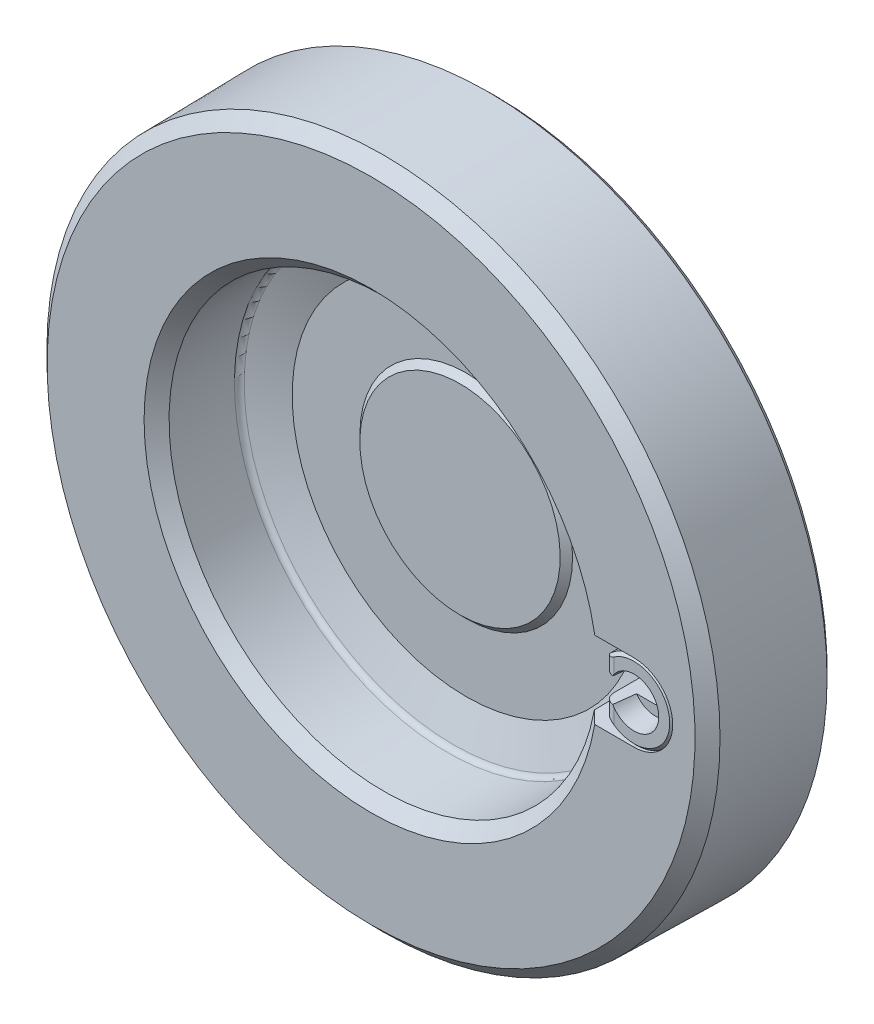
ISO-10303-21;
HEADER;
FILE_DESCRIPTION(('STEP AP214'),'2;1');
FILE_NAME('part.step','',(''),(''),'','','');
FILE_SCHEMA(('AUTOMOTIVE_DESIGN { 1 0 10303 214 1 1 1 1 }'));
ENDSEC;
DATA;
#1=APPLICATION_CONTEXT('core data for automotive mechanical design processes');
#2=APPLICATION_PROTOCOL_DEFINITION('international standard','automotive_design',2000,#1);
#3=PRODUCT_CONTEXT('',#1,'mechanical');
#4=PRODUCT('Part','Part','',(#3));
#5=PRODUCT_RELATED_PRODUCT_CATEGORY('part','',(#4));
#6=PRODUCT_DEFINITION_FORMATION('','',#4);
#7=PRODUCT_DEFINITION_CONTEXT('part definition',#1,'design');
#8=PRODUCT_DEFINITION('design','',#6,#7);
#9=PRODUCT_DEFINITION_SHAPE('','',#8);
#10=(LENGTH_UNIT() NAMED_UNIT(*) SI_UNIT(.MILLI.,.METRE.));
#11=(NAMED_UNIT(*) PLANE_ANGLE_UNIT() SI_UNIT($,.RADIAN.));
#12=(NAMED_UNIT(*) SI_UNIT($,.STERADIAN.) SOLID_ANGLE_UNIT());
#13=UNCERTAINTY_MEASURE_WITH_UNIT(LENGTH_MEASURE(1.E-05),#10,'distance_accuracy_value','');
#14=(GEOMETRIC_REPRESENTATION_CONTEXT(3) GLOBAL_UNCERTAINTY_ASSIGNED_CONTEXT((#13)) GLOBAL_UNIT_ASSIGNED_CONTEXT((#10,
#11,#12)) REPRESENTATION_CONTEXT('',''));
#15=CARTESIAN_POINT('',(0.,0.,0.));
#16=DIRECTION('',(0.,0.,1.));
#17=DIRECTION('',(1.,0.,0.));
#18=AXIS2_PLACEMENT_3D('',#15,#16,#17);
#19=CARTESIAN_POINT('',(-19.25,0.,0.));
#20=DIRECTION('',(0.,0.,1.));
#21=DIRECTION('',(0.,1.,0.));
#22=AXIS2_PLACEMENT_3D('',#19,#20,#21);
#23=PLANE('',#22);
#24=CARTESIAN_POINT('',(0.,0.,0.));
#25=DIRECTION('',(0.,0.,1.));
#26=DIRECTION('',(0.,1.,0.));
#27=AXIS2_PLACEMENT_3D('',#24,#25,#26);
#28=CIRCLE('',#27,19.25);
#29=CARTESIAN_POINT('',(0.,19.25,0.));
#30=VERTEX_POINT('',#29);
#31=EDGE_CURVE('E270',#30,#30,#28,.T.);
#32=ORIENTED_EDGE('',*,*,#31,.F.);
#33=EDGE_LOOP('',(#32));
#34=FACE_BOUND('',#33,.T.);
#35=ADVANCED_FACE('F14',(#34),#23,.F.);
#36=CARTESIAN_POINT('',(0.,0.,0.75));
#37=DIRECTION('',(0.,0.,1.));
#38=DIRECTION('',(0.,1.,0.));
#39=AXIS2_PLACEMENT_3D('',#36,#37,#38);
#40=CONICAL_SURFACE('',#39,20.,0.785398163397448);
#41=CARTESIAN_POINT('',(0.,0.,0.75));
#42=DIRECTION('',(0.,0.,1.));
#43=DIRECTION('',(0.,1.,0.));
#44=AXIS2_PLACEMENT_3D('',#41,#42,#43);
#45=CIRCLE('',#44,20.);
#46=CARTESIAN_POINT('',(0.,20.,0.75));
#47=VERTEX_POINT('',#46);
#48=EDGE_CURVE('E277',#47,#47,#45,.T.);
#49=ORIENTED_EDGE('',*,*,#48,.F.);
#50=EDGE_LOOP('',(#49));
#51=FACE_BOUND('',#50,.T.);
#52=ORIENTED_EDGE('',*,*,#31,.T.);
#53=EDGE_LOOP('',(#52));
#54=FACE_BOUND('',#53,.T.);
#55=ADVANCED_FACE('F231',(#51,#54),#40,.T.);
#56=CARTESIAN_POINT('',(0.,0.,0.));
#57=DIRECTION('',(0.,0.,1.));
#58=DIRECTION('',(0.,1.,0.));
#59=AXIS2_PLACEMENT_3D('',#56,#57,#58);
#60=CYLINDRICAL_SURFACE('',#59,20.);
#61=CARTESIAN_POINT('',(0.,0.,15.));
#62=DIRECTION('',(0.,0.,1.));
#63=DIRECTION('',(0.,1.,0.));
#64=AXIS2_PLACEMENT_3D('',#61,#62,#63);
#65=CIRCLE('',#64,20.);
#66=CARTESIAN_POINT('',(0.,20.,15.));
#67=VERTEX_POINT('',#66);
#68=EDGE_CURVE('E278',#67,#67,#65,.F.);
#69=ORIENTED_EDGE('',*,*,#68,.T.);
#70=EDGE_LOOP('',(#69));
#71=FACE_BOUND('',#70,.T.);
#72=ORIENTED_EDGE('',*,*,#48,.T.);
#73=EDGE_LOOP('',(#72));
#74=FACE_BOUND('',#73,.T.);
#75=ADVANCED_FACE('F228',(#71,#74),#60,.T.);
#76=CARTESIAN_POINT('',(-28.,0.,15.));
#77=DIRECTION('',(0.,0.,1.));
#78=DIRECTION('',(0.,1.,0.));
#79=AXIS2_PLACEMENT_3D('',#76,#77,#78);
#80=PLANE('',#79);
#81=CARTESIAN_POINT('',(0.,0.,15.));
#82=DIRECTION('',(0.,0.,1.));
#83=DIRECTION('',(0.,1.,0.));
#84=AXIS2_PLACEMENT_3D('',#81,#82,#83);
#85=CIRCLE('',#84,28.);
#86=CARTESIAN_POINT('',(0.,28.,15.));
#87=VERTEX_POINT('',#86);
#88=EDGE_CURVE('E189',#87,#87,#85,.T.);
#89=ORIENTED_EDGE('',*,*,#88,.F.);
#90=EDGE_LOOP('',(#89));
#91=FACE_BOUND('',#90,.T.);
#92=ORIENTED_EDGE('',*,*,#68,.F.);
#93=EDGE_LOOP('',(#92));
#94=FACE_BOUND('',#93,.T.);
#95=ADVANCED_FACE('F226',(#91,#94),#80,.F.);
#96=CARTESIAN_POINT('',(0.,0.,0.));
#97=DIRECTION('',(0.,0.,1.));
#98=DIRECTION('',(0.,1.,0.));
#99=AXIS2_PLACEMENT_3D('',#96,#97,#98);
#100=CYLINDRICAL_SURFACE('',#99,28.);
#101=CARTESIAN_POINT('',(0.,0.,23.5167986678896));
#102=DIRECTION('',(0.,0.,-1.));
#103=DIRECTION('',(0.,-1.,0.));
#104=AXIS2_PLACEMENT_3D('',#101,#102,#103);
#105=CIRCLE('',#104,28.);
#106=CARTESIAN_POINT('',(0.,-28.,23.5167986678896));
#107=VERTEX_POINT('',#106);
#108=EDGE_CURVE('E663',#107,#107,#105,.T.);
#109=ORIENTED_EDGE('',*,*,#108,.T.);
#110=EDGE_LOOP('',(#109));
#111=FACE_BOUND('',#110,.T.);
#112=ORIENTED_EDGE('',*,*,#88,.T.);
#113=EDGE_LOOP('',(#112));
#114=FACE_BOUND('',#113,.T.);
#115=ADVANCED_FACE('F312',(#111,#114),#100,.T.);
#116=CARTESIAN_POINT('',(0.,0.,23.5167986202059));
#117=DIRECTION('',(0.,0.,-1.));
#118=DIRECTION('',(0.,-1.,0.));
#119=AXIS2_PLACEMENT_3D('',#116,#117,#118);
#120=TOROIDAL_SURFACE('',#119,31.2,3.2);
#121=CARTESIAN_POINT('',(0.,0.,26.2880799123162));
#122=DIRECTION('',(0.,0.,1.));
#123=DIRECTION('',(0.,1.,0.));
#124=AXIS2_PLACEMENT_3D('',#121,#122,#123);
#125=CIRCLE('',#124,29.6);
#126=CARTESIAN_POINT('',(0.,29.6,26.2880799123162));
#127=VERTEX_POINT('',#126);
#128=EDGE_CURVE('E708',#127,#127,#125,.T.);
#129=ORIENTED_EDGE('',*,*,#128,.F.);
#130=EDGE_LOOP('',(#129));
#131=FACE_BOUND('',#130,.T.);
#132=ORIENTED_EDGE('',*,*,#108,.F.);
#133=EDGE_LOOP('',(#132));
#134=FACE_BOUND('',#133,.T.);
#135=ADVANCED_FACE('F686',(#131,#134),#120,.F.);
#136=CARTESIAN_POINT('',(0.,0.,35.8143593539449));
#137=DIRECTION('',(0.,0.,1.));
#138=DIRECTION('',(0.,1.,0.));
#139=AXIS2_PLACEMENT_3D('',#136,#137,#138);
#140=CONICAL_SURFACE('',#139,46.1,1.0471975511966);
#141=CARTESIAN_POINT('',(0.,0.,35.8143593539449));
#142=DIRECTION('',(0.,0.,-1.));
#143=DIRECTION('',(0.,-1.,0.));
#144=AXIS2_PLACEMENT_3D('',#141,#142,#143);
#145=CIRCLE('',#144,46.1);
#146=CARTESIAN_POINT('',(0.,-46.1,35.8143593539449));
#147=VERTEX_POINT('',#146);
#148=EDGE_CURVE('E713',#147,#147,#145,.T.);
#149=ORIENTED_EDGE('',*,*,#148,.T.);
#150=EDGE_LOOP('',(#149));
#151=FACE_BOUND('',#150,.T.);
#152=ORIENTED_EDGE('',*,*,#128,.T.);
#153=EDGE_LOOP('',(#152));
#154=FACE_BOUND('',#153,.T.);
#155=ADVANCED_FACE('F691',(#151,#154),#140,.T.);
#156=CARTESIAN_POINT('',(0.,0.,34.4287187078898));
#157=DIRECTION('',(0.,0.,-1.));
#158=DIRECTION('',(0.,-1.,0.));
#159=AXIS2_PLACEMENT_3D('',#156,#157,#158);
#160=TOROIDAL_SURFACE('',#159,46.9,1.6);
#161=CARTESIAN_POINT('',(0.,0.,34.4287187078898));
#162=DIRECTION('',(0.,0.,1.));
#163=DIRECTION('',(0.,1.,0.));
#164=AXIS2_PLACEMENT_3D('',#161,#162,#163);
#165=CIRCLE('',#164,48.5);
#166=CARTESIAN_POINT('',(0.,48.5,34.4287187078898));
#167=VERTEX_POINT('',#166);
#168=EDGE_CURVE('E759',#167,#167,#165,.F.);
#169=ORIENTED_EDGE('',*,*,#168,.T.);
#170=EDGE_LOOP('',(#169));
#171=FACE_BOUND('',#170,.T.);
#172=ORIENTED_EDGE('',*,*,#148,.F.);
#173=EDGE_LOOP('',(#172));
#174=FACE_BOUND('',#173,.T.);
#175=ADVANCED_FACE('F775',(#171,#174),#160,.F.);
#176=CARTESIAN_POINT('',(0.,0.,43.));
#177=DIRECTION('',(0.,0.,-1.));
#178=DIRECTION('',(0.,-1.,0.));
#179=AXIS2_PLACEMENT_3D('',#176,#177,#178);
#180=PLANE('',#179);
#181=CARTESIAN_POINT('',(0.,0.,43.));
#182=DIRECTION('',(0.,0.,-1.));
#183=DIRECTION('',(0.,-1.,0.));
#184=AXIS2_PLACEMENT_3D('',#181,#182,#183);
#185=CIRCLE('',#184,25.9);
#186=CARTESIAN_POINT('',(0.,-25.9,43.));
#187=VERTEX_POINT('',#186);
#188=EDGE_CURVE('E18',#187,#187,#185,.T.);
#189=ORIENTED_EDGE('',*,*,#188,.F.);
#190=EDGE_LOOP('',(#189));
#191=FACE_BOUND('',#190,.T.);
#192=ADVANCED_FACE('F16',(#191),#180,.F.);
#193=CARTESIAN_POINT('',(0.,0.,0.));
#194=DIRECTION('',(0.,0.,1.));
#195=DIRECTION('',(0.,1.,0.));
#196=AXIS2_PLACEMENT_3D('',#193,#194,#195);
#197=CYLINDRICAL_SURFACE('',#196,48.5);
#198=CARTESIAN_POINT('',(0.,0.,34.));
#199=DIRECTION('',(0.,0.,1.));
#200=DIRECTION('',(0.,1.,0.));
#201=AXIS2_PLACEMENT_3D('',#198,#199,#200);
#202=CIRCLE('',#201,48.5);
#203=CARTESIAN_POINT('',(0.,48.5,34.));
#204=VERTEX_POINT('',#203);
#205=EDGE_CURVE('E714',#204,#204,#202,.F.);
#206=ORIENTED_EDGE('',*,*,#205,.T.);
#207=EDGE_LOOP('',(#206));
#208=FACE_BOUND('',#207,.T.);
#209=ORIENTED_EDGE('',*,*,#168,.F.);
#210=EDGE_LOOP('',(#209));
#211=FACE_BOUND('',#210,.T.);
#212=ADVANCED_FACE('F252',(#208,#211),#197,.F.);
#213=CARTESIAN_POINT('',(0.,0.,41.4));
#214=DIRECTION('',(0.,0.,-1.));
#215=DIRECTION('',(0.,-1.,0.));
#216=AXIS2_PLACEMENT_3D('',#213,#214,#215);
#217=CONICAL_SURFACE('',#216,27.5,0.785398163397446);
#218=ORIENTED_EDGE('',*,*,#188,.T.);
#219=EDGE_LOOP('',(#218));
#220=FACE_BOUND('',#219,.T.);
#221=CARTESIAN_POINT('',(0.,0.,41.4));
#222=DIRECTION('',(0.,0.,-1.));
#223=DIRECTION('',(0.,-1.,0.));
#224=AXIS2_PLACEMENT_3D('',#221,#222,#223);
#225=CIRCLE('',#224,27.5);
#226=CARTESIAN_POINT('',(0.,-27.5,41.4));
#227=VERTEX_POINT('',#226);
#228=EDGE_CURVE('E269',#227,#227,#225,.F.);
#229=ORIENTED_EDGE('',*,*,#228,.T.);
#230=EDGE_LOOP('',(#229));
#231=FACE_BOUND('',#230,.T.);
#232=ADVANCED_FACE('F250',(#220,#231),#217,.T.);
#233=CARTESIAN_POINT('',(-85.9279281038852,0.,34.));
#234=DIRECTION('',(0.,0.,1.));
#235=DIRECTION('',(0.,1.,0.));
#236=AXIS2_PLACEMENT_3D('',#233,#234,#235);
#237=PLANE('',#236);
#238=CARTESIAN_POINT('',(0.,0.,34.));
#239=DIRECTION('',(0.,0.,1.));
#240=DIRECTION('',(0.,1.,0.));
#241=AXIS2_PLACEMENT_3D('',#238,#239,#240);
#242=CIRCLE('',#241,85.9279281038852);
#243=CARTESIAN_POINT('',(0.,85.9279281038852,34.));
#244=VERTEX_POINT('',#243);
#245=EDGE_CURVE('E606',#244,#244,#242,.T.);
#246=ORIENTED_EDGE('',*,*,#245,.F.);
#247=EDGE_LOOP('',(#246));
#248=FACE_BOUND('',#247,.T.);
#249=ORIENTED_EDGE('',*,*,#205,.F.);
#250=EDGE_LOOP('',(#249));
#251=FACE_BOUND('',#250,.T.);
#252=ADVANCED_FACE('F246',(#248,#251),#237,.F.);
#253=CARTESIAN_POINT('',(-27.5,0.,41.4));
#254=DIRECTION('',(0.,0.,-1.));
#255=DIRECTION('',(0.,-1.,0.));
#256=AXIS2_PLACEMENT_3D('',#253,#254,#255);
#257=PLANE('',#256);
#258=ORIENTED_EDGE('',*,*,#228,.F.);
#259=EDGE_LOOP('',(#258));
#260=FACE_BOUND('',#259,.T.);
#261=CARTESIAN_POINT('',(0.,0.,41.4));
#262=DIRECTION('',(0.,0.,1.));
#263=DIRECTION('',(0.,1.,0.));
#264=AXIS2_PLACEMENT_3D('',#261,#262,#263);
#265=CIRCLE('',#264,45.);
#266=CARTESIAN_POINT('',(0.,45.,41.4));
#267=VERTEX_POINT('',#266);
#268=EDGE_CURVE('E272',#267,#267,#265,.T.);
#269=ORIENTED_EDGE('',*,*,#268,.T.);
#270=EDGE_LOOP('',(#269));
#271=FACE_BOUND('',#270,.T.);
#272=ADVANCED_FACE('F242',(#260,#271),#257,.F.);
#273=CARTESIAN_POINT('',(0.,0.,35.5997563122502));
#274=DIRECTION('',(0.,0.,1.));
#275=DIRECTION('',(0.,1.,0.));
#276=AXIS2_PLACEMENT_3D('',#273,#274,#275);
#277=CONICAL_SURFACE('',#276,87.5000042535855,0.77667151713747);
#278=CARTESIAN_POINT('',(0.,0.,35.5997563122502));
#279=DIRECTION('',(0.,0.,1.));
#280=DIRECTION('',(0.,1.,0.));
#281=AXIS2_PLACEMENT_3D('',#278,#279,#280);
#282=CIRCLE('',#281,87.5000042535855);
#283=CARTESIAN_POINT('',(0.,87.5000042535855,35.5997563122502));
#284=VERTEX_POINT('',#283);
#285=EDGE_CURVE('E717',#284,#284,#282,.F.);
#286=ORIENTED_EDGE('',*,*,#285,.T.);
#287=EDGE_LOOP('',(#286));
#288=FACE_BOUND('',#287,.T.);
#289=ORIENTED_EDGE('',*,*,#245,.T.);
#290=EDGE_LOOP('',(#289));
#291=FACE_BOUND('',#290,.T.);
#292=ADVANCED_FACE('F245',(#288,#291),#277,.T.);
#293=CARTESIAN_POINT('',(68.,0.,46.5));
#294=DIRECTION('',(0.,0.,1.));
#295=DIRECTION('',(0.,1.,0.));
#296=AXIS2_PLACEMENT_3D('',#293,#294,#295);
#297=PLANE('',#296);
#298=CARTESIAN_POINT('',(74.,0.,46.5));
#299=DIRECTION('',(0.,0.,-1.));
#300=DIRECTION('',(0.,-1.,0.));
#301=AXIS2_PLACEMENT_3D('',#298,#299,#300);
#302=CIRCLE('',#301,2.99999999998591);
#303=CARTESIAN_POINT('',(74.,-2.99999999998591,46.5));
#304=VERTEX_POINT('',#303);
#305=EDGE_CURVE('E643',#304,#304,#302,.T.);
#306=ORIENTED_EDGE('',*,*,#305,.F.);
#307=EDGE_LOOP('',(#306));
#308=FACE_BOUND('',#307,.T.);
#309=ADVANCED_FACE('F237',(#308),#297,.T.);
#310=CARTESIAN_POINT('',(0.,0.,44.7109161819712));
#311=DIRECTION('',(0.,0.,1.));
#312=DIRECTION('',(0.,1.,0.));
#313=AXIS2_PLACEMENT_3D('',#310,#311,#312);
#314=CONICAL_SURFACE('',#313,54.0966674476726,1.22173047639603);
#315=ORIENTED_EDGE('',*,*,#268,.F.);
#316=EDGE_LOOP('',(#315));
#317=FACE_BOUND('',#316,.T.);
#318=CARTESIAN_POINT('',(0.,0.,44.7109161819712));
#319=DIRECTION('',(0.,0.,-1.));
#320=DIRECTION('',(0.,-1.,0.));
#321=AXIS2_PLACEMENT_3D('',#318,#319,#320);
#322=CIRCLE('',#321,54.0966674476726);
#323=CARTESIAN_POINT('',(0.,-54.0966674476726,44.7109161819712));
#324=VERTEX_POINT('',#323);
#325=EDGE_CURVE('E216',#324,#324,#322,.F.);
#326=ORIENTED_EDGE('',*,*,#325,.T.);
#327=EDGE_LOOP('',(#326));
#328=FACE_BOUND('',#327,.T.);
#329=ADVANCED_FACE('F233',(#317,#328),#314,.F.);
#330=CARTESIAN_POINT('',(0.,0.,35.599756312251));
#331=DIRECTION('',(0.,0.,-1.));
#332=DIRECTION('',(0.,-1.,0.));
#333=AXIS2_PLACEMENT_3D('',#330,#331,#332);
#334=CONICAL_SURFACE('',#333,87.5000042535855,0.0174532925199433);
#335=CARTESIAN_POINT('',(0.,0.,62.8004873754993));
#336=DIRECTION('',(0.,0.,-1.));
#337=DIRECTION('',(0.,-1.,0.));
#338=AXIS2_PLACEMENT_3D('',#335,#336,#337);
#339=CIRCLE('',#338,87.0252137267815);
#340=CARTESIAN_POINT('',(0.,-87.0252137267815,62.8004873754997));
#341=VERTEX_POINT('',#340);
#342=EDGE_CURVE('E764',#341,#341,#339,.T.);
#343=ORIENTED_EDGE('',*,*,#342,.T.);
#344=EDGE_LOOP('',(#343));
#345=FACE_BOUND('',#344,.T.);
#346=ORIENTED_EDGE('',*,*,#285,.F.);
#347=EDGE_LOOP('',(#346));
#348=FACE_BOUND('',#347,.T.);
#349=ADVANCED_FACE('F236',(#345,#348),#334,.T.);
#350=CARTESIAN_POINT('',(74.,0.,46.5000000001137));
#351=DIRECTION('',(0.,0.,-1.));
#352=DIRECTION('',(0.,-1.,0.));
#353=AXIS2_PLACEMENT_3D('',#350,#351,#352);
#354=CONICAL_SURFACE('',#353,2.99999999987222,0.785398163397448);
#355=CARTESIAN_POINT('',(74.,0.,47.0414999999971));
#356=DIRECTION('',(0.,0.,-1.));
#357=DIRECTION('',(0.,-1.,0.));
#358=AXIS2_PLACEMENT_3D('',#355,#356,#357);
#359=CIRCLE('',#358,2.45849999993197);
#360=CARTESIAN_POINT('',(74.,-2.45849999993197,47.0414999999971));
#361=VERTEX_POINT('',#360);
#362=EDGE_CURVE('E518',#361,#361,#359,.T.);
#363=ORIENTED_EDGE('',*,*,#362,.F.);
#364=EDGE_LOOP('',(#363));
#365=FACE_BOUND('',#364,.T.);
#366=ORIENTED_EDGE('',*,*,#305,.T.);
#367=EDGE_LOOP('',(#366));
#368=FACE_BOUND('',#367,.T.);
#369=ADVANCED_FACE('F482',(#365,#368),#354,.F.);
#370=CARTESIAN_POINT('',(74.,0.,53.0999999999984));
#371=DIRECTION('',(0.,0.,-1.));
#372=DIRECTION('',(0.,-1.,0.));
#373=AXIS2_PLACEMENT_3D('',#370,#371,#372);
#374=CONICAL_SURFACE('',#373,2.45849999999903,1.0471975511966);
#375=CARTESIAN_POINT('',(74.,0.,54.5194156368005));
#376=VERTEX_POINT('',#375);
#377=VERTEX_LOOP('',#376);
#378=FACE_BOUND('',#377,.T.);
#379=CARTESIAN_POINT('',(74.,0.,53.1));
#380=DIRECTION('',(0.,0.,1.));
#381=DIRECTION('',(0.,1.,0.));
#382=AXIS2_PLACEMENT_3D('',#379,#380,#381);
#383=CIRCLE('',#382,2.4585);
#384=CARTESIAN_POINT('',(72.8419214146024,2.16865770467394,53.0999999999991));
#385=VERTEX_POINT('',#384);
#386=CARTESIAN_POINT('',(72.8419214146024,-2.16865770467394,53.0999999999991));
#387=VERTEX_POINT('',#386);
#388=EDGE_CURVE('E600',#385,#387,#383,.F.);
#389=ORIENTED_EDGE('',*,*,#388,.T.);
#390=CARTESIAN_POINT('',(72.8419214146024,2.1686577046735,53.0999999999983));
#391=CARTESIAN_POINT('',(72.8419214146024,2.11766605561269,53.125966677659));
#392=CARTESIAN_POINT('',(72.8419214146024,2.06659403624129,53.1517764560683));
#393=CARTESIAN_POINT('',(72.8419214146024,1.96425436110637,53.2030079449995));
#394=CARTESIAN_POINT('',(72.8419214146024,1.91298670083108,53.2284296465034));
#395=CARTESIAN_POINT('',(72.8419214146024,1.75866024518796,53.3040882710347));
#396=CARTESIAN_POINT('',(72.8419214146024,1.65525758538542,53.3536265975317));
#397=CARTESIAN_POINT('',(72.8419214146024,1.44196500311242,53.4523173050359));
#398=CARTESIAN_POINT('',(72.8419214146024,1.3320082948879,53.50132783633));
#399=CARTESIAN_POINT('',(72.8419214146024,1.16551537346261,53.5710597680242));
#400=CARTESIAN_POINT('',(72.8419214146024,1.10977253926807,53.5936678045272));
#401=CARTESIAN_POINT('',(72.8419214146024,0.997649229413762,53.6372355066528));
#402=CARTESIAN_POINT('',(72.8419214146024,0.94126881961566,53.6581953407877));
#403=CARTESIAN_POINT('',(72.8419214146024,0.816953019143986,53.7017619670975));
#404=CARTESIAN_POINT('',(72.8419214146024,0.748859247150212,53.7239239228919));
#405=CARTESIAN_POINT('',(72.8419214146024,0.611470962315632,53.7640922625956));
#406=CARTESIAN_POINT('',(72.8419214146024,0.542177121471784,53.782100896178));
#407=CARTESIAN_POINT('',(72.8419214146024,0.403621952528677,53.8123022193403));
#408=CARTESIAN_POINT('',(72.8419214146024,0.33438311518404,53.8245950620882));
#409=CARTESIAN_POINT('',(72.8419214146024,0.19505172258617,53.8425115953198));
#410=CARTESIAN_POINT('',(72.8419214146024,0.124959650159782,53.8481388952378));
#411=CARTESIAN_POINT('',(72.8419214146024,-0.0161703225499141,53.851984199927));
#412=CARTESIAN_POINT('',(72.8419214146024,-0.0872104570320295,53.8501242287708));
#413=CARTESIAN_POINT('',(72.8419214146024,-0.228724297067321,53.8390899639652));
#414=CARTESIAN_POINT('',(72.8419214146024,-0.299197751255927,53.8299125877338));
#415=CARTESIAN_POINT('',(72.8419214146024,-0.440368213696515,53.8051689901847));
#416=CARTESIAN_POINT('',(72.8419214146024,-0.511043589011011,53.7894836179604));
#417=CARTESIAN_POINT('',(72.8419214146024,-0.651107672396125,53.7532215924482));
#418=CARTESIAN_POINT('',(72.8419214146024,-0.720496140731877,53.73264403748));
#419=CARTESIAN_POINT('',(72.8419214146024,-0.850678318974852,53.6903143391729));
#420=CARTESIAN_POINT('',(72.8419214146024,-0.911592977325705,53.6689272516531));
#421=CARTESIAN_POINT('',(72.8419214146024,-1.03262671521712,53.6239969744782));
#422=CARTESIAN_POINT('',(72.8419214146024,-1.09274565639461,53.6004534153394));
#423=CARTESIAN_POINT('',(72.8419214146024,-1.27220871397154,53.5273811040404));
#424=CARTESIAN_POINT('',(72.8419214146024,-1.39056604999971,53.4754428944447));
#425=CARTESIAN_POINT('',(72.8419214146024,-1.61954727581,53.3705708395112));
#426=CARTESIAN_POINT('',(72.8419214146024,-1.73025800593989,53.3178224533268));
#427=CARTESIAN_POINT('',(72.8419214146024,-1.89537790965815,53.2371316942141));
#428=CARTESIAN_POINT('',(72.8419214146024,-1.9501895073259,53.2100096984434));
#429=CARTESIAN_POINT('',(72.8419214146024,-2.05958380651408,53.155317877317));
#430=CARTESIAN_POINT('',(72.8419214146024,-2.11416652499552,53.1277480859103));
#431=CARTESIAN_POINT('',(72.8419214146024,-2.1686577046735,53.0999999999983));
#432=B_SPLINE_CURVE_WITH_KNOTS('',3,(#390,#391,#392,#393,#394,#395,#396,#397,#398,#399,#400,
#401,#402,#403,#404,#405,#406,#407,#408,#409,#410,#411,#412,#413,#414,#415,#416,#417,#418,#419,
#420,#421,#422,#423,#424,#425,#426,#427,#428,#429,#430,#431),.UNSPECIFIED.,.F.,.F.,(4,2,2,2,2,2,
2,2,2,2,2,2,2,2,2,2,2,2,2,2,4),(0.,0.171667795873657,0.343339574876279,0.687288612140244,
1.0483516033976,1.2287908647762,1.40921165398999,1.62394402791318,1.83855981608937,
2.04925844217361,2.25984292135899,2.47262616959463,2.68549910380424,2.90245455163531,
3.11945001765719,3.3130801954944,3.50674361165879,3.89436524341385,4.26224341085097,
4.44570591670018,4.62915457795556),.UNSPECIFIED.);
#433=EDGE_CURVE('E441',#385,#387,#432,.T.);
#434=ORIENTED_EDGE('',*,*,#433,.F.);
#435=EDGE_LOOP('',(#389,#434));
#436=FACE_BOUND('',#435,.T.);
#437=ADVANCED_FACE('F224',(#378,#436),#374,.F.);
#438=CARTESIAN_POINT('',(0.,0.,46.2144243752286));
#439=DIRECTION('',(0.,0.,-1.));
#440=DIRECTION('',(0.,-1.,0.));
#441=AXIS2_PLACEMENT_3D('',#438,#439,#440);
#442=TOROIDAL_SURFACE('',#441,53.5494352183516,1.6);
#443=ORIENTED_EDGE('',*,*,#325,.F.);
#444=EDGE_LOOP('',(#443));
#445=FACE_BOUND('',#444,.T.);
#446=CARTESIAN_POINT('',(0.,0.,46.1865005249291));
#447=DIRECTION('',(0.,0.,1.));
#448=DIRECTION('',(0.,1.,0.));
#449=AXIS2_PLACEMENT_3D('',#446,#447,#448);
#450=CIRCLE('',#449,55.1491915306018);
#451=CARTESIAN_POINT('',(0.,55.1491915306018,46.186500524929));
#452=VERTEX_POINT('',#451);
#453=EDGE_CURVE('E199',#452,#452,#450,.T.);
#454=ORIENTED_EDGE('',*,*,#453,.T.);
#455=EDGE_LOOP('',(#454));
#456=FACE_BOUND('',#455,.T.);
#457=ADVANCED_FACE('F219',(#445,#456),#442,.F.);
#458=CARTESIAN_POINT('',(0.,0.,62.8004873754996));
#459=DIRECTION('',(0.,0.,-1.));
#460=DIRECTION('',(0.,-1.,0.));
#461=AXIS2_PLACEMENT_3D('',#458,#459,#460);
#462=CONICAL_SURFACE('',#461,87.0252137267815,0.79412480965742);
#463=CARTESIAN_POINT('',(0.,0.,66.));
#464=DIRECTION('',(0.,0.,-1.));
#465=DIRECTION('',(0.,-1.,0.));
#466=AXIS2_PLACEMENT_3D('',#463,#464,#465);
#467=CIRCLE('',#466,83.7693660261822);
#468=CARTESIAN_POINT('',(0.,-83.7693660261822,66.));
#469=VERTEX_POINT('',#468);
#470=EDGE_CURVE('E710',#469,#469,#467,.T.);
#471=ORIENTED_EDGE('',*,*,#470,.T.);
#472=EDGE_LOOP('',(#471));
#473=FACE_BOUND('',#472,.T.);
#474=ORIENTED_EDGE('',*,*,#342,.F.);
#475=EDGE_LOOP('',(#474));
#476=FACE_BOUND('',#475,.T.);
#477=ADVANCED_FACE('F223',(#473,#476),#462,.T.);
#478=CARTESIAN_POINT('',(77.22,0.,66.));
#479=DIRECTION('',(0.,0.,-1.));
#480=DIRECTION('',(0.,-1.,0.));
#481=AXIS2_PLACEMENT_3D('',#478,#479,#480);
#482=PLANE('',#481);
#483=CARTESIAN_POINT('',(68.,0.,66.));
#484=DIRECTION('',(0.,0.,-1.));
#485=DIRECTION('',(0.,-1.,0.));
#486=AXIS2_PLACEMENT_3D('',#483,#484,#485);
#487=CIRCLE('',#486,9.22);
#488=CARTESIAN_POINT('',(62.8,7.61369818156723,66.));
#489=VERTEX_POINT('',#488);
#490=CARTESIAN_POINT('',(62.8,-7.61369818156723,66.));
#491=VERTEX_POINT('',#490);
#492=EDGE_CURVE('E412',#489,#491,#487,.T.);
#493=ORIENTED_EDGE('',*,*,#492,.F.);
#494=DIRECTION('',(0.,1.,0.));
#495=VECTOR('',#494,1.);
#496=CARTESIAN_POINT('',(62.8,19.5,66.));
#497=LINE('',#496,#495);
#498=CARTESIAN_POINT('',(62.7999999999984,3.68790252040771,65.9999999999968));
#499=VERTEX_POINT('',#498);
#500=EDGE_CURVE('E558',#499,#489,#497,.T.);
#501=ORIENTED_EDGE('',*,*,#500,.F.);
#502=CARTESIAN_POINT('',(68.,0.,65.9999999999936));
#503=DIRECTION('',(0.,0.,1.));
#504=DIRECTION('',(0.,1.,0.));
#505=AXIS2_PLACEMENT_3D('',#502,#503,#504);
#506=CIRCLE('',#505,6.37500000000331);
#507=CARTESIAN_POINT('',(62.7999999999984,-3.68790252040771,65.9999999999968));
#508=VERTEX_POINT('',#507);
#509=EDGE_CURVE('E526',#508,#499,#506,.T.);
#510=ORIENTED_EDGE('',*,*,#509,.F.);
#511=DIRECTION('',(0.,1.,0.));
#512=VECTOR('',#511,1.);
#513=CARTESIAN_POINT('',(62.8,19.5,66.));
#514=LINE('',#513,#512);
#515=EDGE_CURVE('E402',#491,#508,#514,.T.);
#516=ORIENTED_EDGE('',*,*,#515,.F.);
#517=EDGE_LOOP('',(#493,#501,#510,#516));
#518=FACE_BOUND('',#517,.T.);
#519=ADVANCED_FACE('F490',(#518),#482,.F.);
#520=CARTESIAN_POINT('',(68.,0.,65.22));
#521=DIRECTION('',(0.,0.,-1.));
#522=DIRECTION('',(0.,-1.,0.));
#523=AXIS2_PLACEMENT_3D('',#520,#521,#522);
#524=CONICAL_SURFACE('',#523,9.99999999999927,0.785398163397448);
#525=CARTESIAN_POINT('',(68.,0.,65.2200000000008));
#526=DIRECTION('',(0.,0.,-1.));
#527=DIRECTION('',(0.,-1.,0.));
#528=AXIS2_PLACEMENT_3D('',#525,#526,#527);
#529=CIRCLE('',#528,10.);
#530=CARTESIAN_POINT('',(60.8610312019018,7.0025084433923,65.22));
#531=VERTEX_POINT('',#530);
#532=CARTESIAN_POINT('',(68.,10.,65.2200000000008));
#533=VERTEX_POINT('',#532);
#534=EDGE_CURVE('E371',#531,#533,#529,.T.);
#535=ORIENTED_EDGE('',*,*,#534,.F.);
#536=CARTESIAN_POINT('',(60.8610312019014,7.00250844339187,65.22));
#537=CARTESIAN_POINT('',(60.8960826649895,6.99016189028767,65.253665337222));
#538=CARTESIAN_POINT('',(60.932414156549,6.97988335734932,65.286766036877));
#539=CARTESIAN_POINT('',(61.0072953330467,6.96356749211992,65.3514261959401));
#540=CARTESIAN_POINT('',(61.045843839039,6.95752792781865,65.3829864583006));
#541=CARTESIAN_POINT('',(61.1243448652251,6.94983192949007,65.4437950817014));
#542=CARTESIAN_POINT('',(61.1642728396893,6.94811992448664,65.4730680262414));
#543=CARTESIAN_POINT('',(61.2455854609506,6.94880413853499,65.5294308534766));
#544=CARTESIAN_POINT('',(61.2869700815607,6.95120028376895,65.5565207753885));
#545=CARTESIAN_POINT('',(61.4125795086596,6.96421802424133,65.6340691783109));
#546=CARTESIAN_POINT('',(61.49846876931,6.98065079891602,65.6809676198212));
#547=CARTESIAN_POINT('',(61.671963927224,7.02623082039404,65.7645455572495));
#548=CARTESIAN_POINT('',(61.7595748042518,7.05542263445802,65.8011884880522));
#549=CARTESIAN_POINT('',(61.9710262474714,7.13759694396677,65.8777171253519));
#550=CARTESIAN_POINT('',(62.0947664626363,7.19542440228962,65.9126028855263));
#551=CARTESIAN_POINT('',(62.3392826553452,7.32364862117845,65.9646736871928));
#552=CARTESIAN_POINT('',(62.4600548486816,7.39406056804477,65.9818371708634));
#553=CARTESIAN_POINT('',(62.6160757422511,7.49203863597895,65.9942034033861));
#554=CARTESIAN_POINT('',(62.6532437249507,7.51591847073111,65.9963958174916));
#555=CARTESIAN_POINT('',(62.7270109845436,7.56432341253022,65.9992910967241));
#556=CARTESIAN_POINT('',(62.7636119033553,7.58884567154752,65.9999996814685));
#557=CARTESIAN_POINT('',(62.8,7.6136981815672,66.));
#558=B_SPLINE_CURVE_WITH_KNOTS('',3,(#536,#537,#538,#539,#540,#541,#542,#543,#544,#545,#546,
#547,#548,#549,#550,#551,#552,#553,#554,#555,#556,#557),.UNSPECIFIED.,.F.,.F.,(4,2,2,2,2,2,2,2,
2,2,4),(0.,0.150380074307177,0.300680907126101,0.44904166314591,0.597399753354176,
0.893335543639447,1.19031340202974,1.61091753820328,2.03203270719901,2.16471044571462,
2.29687581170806),.UNSPECIFIED.);
#559=EDGE_CURVE('E403',#531,#489,#558,.T.);
#560=ORIENTED_EDGE('',*,*,#559,.T.);
#561=ORIENTED_EDGE('',*,*,#492,.T.);
#562=CARTESIAN_POINT('',(60.8610312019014,-7.00250844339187,65.22));
#563=CARTESIAN_POINT('',(60.8960826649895,-6.99016189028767,65.253665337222));
#564=CARTESIAN_POINT('',(60.932414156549,-6.97988335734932,65.286766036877));
#565=CARTESIAN_POINT('',(61.0072953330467,-6.96356749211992,65.3514261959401));
#566=CARTESIAN_POINT('',(61.045843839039,-6.95752792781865,65.3829864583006));
#567=CARTESIAN_POINT('',(61.1243448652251,-6.94983192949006,65.4437950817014));
#568=CARTESIAN_POINT('',(61.1642728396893,-6.94811992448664,65.4730680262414));
#569=CARTESIAN_POINT('',(61.2455854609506,-6.948804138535,65.5294308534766));
#570=CARTESIAN_POINT('',(61.2869700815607,-6.95120028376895,65.5565207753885));
#571=CARTESIAN_POINT('',(61.4125795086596,-6.96421802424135,65.6340691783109));
#572=CARTESIAN_POINT('',(61.49846876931,-6.98065079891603,65.6809676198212));
#573=CARTESIAN_POINT('',(61.671963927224,-7.02623082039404,65.7645455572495));
#574=CARTESIAN_POINT('',(61.7595748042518,-7.05542263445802,65.8011884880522));
#575=CARTESIAN_POINT('',(61.9710262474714,-7.13759694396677,65.8777171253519));
#576=CARTESIAN_POINT('',(62.0947664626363,-7.19542440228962,65.9126028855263));
#577=CARTESIAN_POINT('',(62.3392826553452,-7.32364862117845,65.9646736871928));
#578=CARTESIAN_POINT('',(62.4600548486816,-7.39406056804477,65.9818371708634));
#579=CARTESIAN_POINT('',(62.6160757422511,-7.49203863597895,65.9942034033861));
#580=CARTESIAN_POINT('',(62.6532437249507,-7.51591847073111,65.9963958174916));
#581=CARTESIAN_POINT('',(62.7270109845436,-7.56432341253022,65.9992910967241));
#582=CARTESIAN_POINT('',(62.7636119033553,-7.58884567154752,65.9999996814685));
#583=CARTESIAN_POINT('',(62.8,-7.6136981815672,66.));
#584=B_SPLINE_CURVE_WITH_KNOTS('',3,(#562,#563,#564,#565,#566,#567,#568,#569,#570,#571,#572,
#573,#574,#575,#576,#577,#578,#579,#580,#581,#582,#583),.UNSPECIFIED.,.F.,.F.,(4,2,2,2,2,2,2,2,
2,2,4),(0.,0.150380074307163,0.300680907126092,0.44904166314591,0.597399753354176,
0.893335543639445,1.19031340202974,1.61091753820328,2.03203270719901,2.16471044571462,
2.29687581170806),.UNSPECIFIED.);
#585=CARTESIAN_POINT('',(60.8610312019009,-7.00250844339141,65.22));
#586=VERTEX_POINT('',#585);
#587=EDGE_CURVE('E394',#586,#491,#584,.T.);
#588=ORIENTED_EDGE('',*,*,#587,.F.);
#589=CARTESIAN_POINT('',(68.,-10.,65.2200000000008));
#590=VERTEX_POINT('',#589);
#591=EDGE_CURVE('E628',#590,#586,#529,.T.);
#592=ORIENTED_EDGE('',*,*,#591,.F.);
#593=EDGE_CURVE('E634',#533,#590,#529,.T.);
#594=ORIENTED_EDGE('',*,*,#593,.F.);
#595=EDGE_LOOP('',(#535,#560,#561,#588,#592,#594));
#596=FACE_BOUND('',#595,.T.);
#597=ADVANCED_FACE('F388',(#596),#524,.T.);
#598=DIRECTION('',(-1.,0.,0.));
#599=VECTOR('',#598,1.);
#600=CARTESIAN_POINT('',(0.,-10.,46.5));
#601=LINE('',#600,#599);
#602=CARTESIAN_POINT('',(68.,-10.,46.5));
#603=VERTEX_POINT('',#602);
#604=CARTESIAN_POINT('',(54.2405468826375,-10.,46.5));
#605=VERTEX_POINT('',#604);
#606=EDGE_CURVE('E659',#603,#605,#601,.T.);
#607=ORIENTED_EDGE('',*,*,#606,.F.);
#608=CARTESIAN_POINT('',(68.,0.,46.5));
#609=DIRECTION('',(0.,0.,-1.));
#610=DIRECTION('',(0.,-1.,0.));
#611=AXIS2_PLACEMENT_3D('',#608,#609,#610);
#612=CIRCLE('',#611,10.);
#613=CARTESIAN_POINT('',(60.,-6.,46.5));
#614=VERTEX_POINT('',#613);
#615=EDGE_CURVE('E372',#614,#603,#612,.F.);
#616=ORIENTED_EDGE('',*,*,#615,.F.);
#617=DIRECTION('',(0.,1.,0.));
#618=VECTOR('',#617,1.);
#619=CARTESIAN_POINT('',(60.,0.,46.5));
#620=LINE('',#619,#618);
#621=CARTESIAN_POINT('',(60.,6.,46.5));
#622=VERTEX_POINT('',#621);
#623=EDGE_CURVE('E564',#622,#614,#620,.F.);
#624=ORIENTED_EDGE('',*,*,#623,.F.);
#625=CARTESIAN_POINT('',(68.,10.,46.5));
#626=VERTEX_POINT('',#625);
#627=EDGE_CURVE('E203',#626,#622,#612,.F.);
#628=ORIENTED_EDGE('',*,*,#627,.F.);
#629=DIRECTION('',(1.,0.,0.));
#630=VECTOR('',#629,1.);
#631=CARTESIAN_POINT('',(68.,10.,46.5));
#632=LINE('',#631,#630);
#633=CARTESIAN_POINT('',(54.2405468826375,10.,46.5));
#634=VERTEX_POINT('',#633);
#635=EDGE_CURVE('E184',#634,#626,#632,.T.);
#636=ORIENTED_EDGE('',*,*,#635,.F.);
#637=CARTESIAN_POINT('',(0.,0.,46.5));
#638=DIRECTION('',(0.,0.,1.));
#639=DIRECTION('',(0.,1.,0.));
#640=AXIS2_PLACEMENT_3D('',#637,#638,#639);
#641=CIRCLE('',#640,55.1546636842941);
#642=EDGE_CURVE('E193',#634,#605,#641,.F.);
#643=ORIENTED_EDGE('',*,*,#642,.T.);
#644=EDGE_LOOP('',(#607,#616,#624,#628,#636,#643));
#645=FACE_BOUND('',#644,.T.);
#646=ADVANCED_FACE('F201',(#645),#297,.T.);
#647=CARTESIAN_POINT('',(0.,0.,62.8004873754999));
#648=DIRECTION('',(0.,0.,1.));
#649=DIRECTION('',(0.,1.,0.));
#650=AXIS2_PLACEMENT_3D('',#647,#648,#649);
#651=CONICAL_SURFACE('',#650,55.4391897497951,0.0174532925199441);
#652=ORIENTED_EDGE('',*,*,#453,.F.);
#653=EDGE_LOOP('',(#652));
#654=FACE_BOUND('',#653,.T.);
#655=CARTESIAN_POINT('',(54.2405468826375,-10.,46.5));
#656=CARTESIAN_POINT('',(54.2887670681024,-10.,49.216747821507));
#657=CARTESIAN_POINT('',(54.3369851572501,-10.,51.9334956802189));
#658=CARTESIAN_POINT('',(54.4334171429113,-10.,57.3669914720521));
#659=CARTESIAN_POINT('',(54.4816310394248,-10.,60.0837394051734));
#660=CARTESIAN_POINT('',(54.5298428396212,-10.,62.8004873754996));
#661=B_SPLINE_CURVE_WITH_KNOTS('',3,(#655,#656,#657,#658,#659,#660),.UNSPECIFIED.,.F.,.F.,(4,2,
4),(0.,8.15152717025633,16.3030543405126),.UNSPECIFIED.);
#662=CARTESIAN_POINT('',(54.5298428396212,-10.,62.8004873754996));
#663=VERTEX_POINT('',#662);
#664=EDGE_CURVE('E195',#605,#663,#661,.T.);
#665=ORIENTED_EDGE('',*,*,#664,.F.);
#666=ORIENTED_EDGE('',*,*,#642,.F.);
#667=CARTESIAN_POINT('',(54.5298428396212,10.,62.8004873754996));
#668=CARTESIAN_POINT('',(54.4816310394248,10.,60.0837394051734));
#669=CARTESIAN_POINT('',(54.4334171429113,10.,57.3669914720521));
#670=CARTESIAN_POINT('',(54.3369851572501,10.,51.9334956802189));
#671=CARTESIAN_POINT('',(54.2887670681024,10.,49.216747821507));
#672=CARTESIAN_POINT('',(54.2405468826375,10.,46.5));
#673=B_SPLINE_CURVE_WITH_KNOTS('',3,(#667,#668,#669,#670,#671,#672),.UNSPECIFIED.,.F.,.F.,(4,2,
4),(0.,8.1515271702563,16.3030543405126),.UNSPECIFIED.);
#674=CARTESIAN_POINT('',(54.5298428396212,10.,62.8004873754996));
#675=VERTEX_POINT('',#674);
#676=EDGE_CURVE('E178',#675,#634,#673,.T.);
#677=ORIENTED_EDGE('',*,*,#676,.F.);
#678=CARTESIAN_POINT('',(0.,0.,62.8004873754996));
#679=DIRECTION('',(0.,0.,1.));
#680=DIRECTION('',(0.,1.,0.));
#681=AXIS2_PLACEMENT_3D('',#678,#679,#680);
#682=CIRCLE('',#681,55.4391897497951);
#683=EDGE_CURVE('E734',#675,#663,#682,.T.);
#684=ORIENTED_EDGE('',*,*,#683,.T.);
#685=EDGE_LOOP('',(#665,#666,#677,#684));
#686=FACE_BOUND('',#685,.T.);
#687=ADVANCED_FACE('F194',(#654,#686),#651,.F.);
#688=CARTESIAN_POINT('',(0.,0.,66.));
#689=DIRECTION('',(0.,0.,1.));
#690=DIRECTION('',(0.,1.,0.));
#691=AXIS2_PLACEMENT_3D('',#688,#689,#690);
#692=CONICAL_SURFACE('',#691,58.6950374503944,0.794124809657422);
#693=CARTESIAN_POINT('',(0.,0.,66.));
#694=DIRECTION('',(0.,0.,1.));
#695=DIRECTION('',(0.,1.,0.));
#696=AXIS2_PLACEMENT_3D('',#693,#694,#695);
#697=CIRCLE('',#696,58.6950374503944);
#698=CARTESIAN_POINT('',(57.8369036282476,10.,66.));
#699=VERTEX_POINT('',#698);
#700=CARTESIAN_POINT('',(57.8369036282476,-10.,66.));
#701=VERTEX_POINT('',#700);
#702=EDGE_CURVE('E703',#699,#701,#697,.T.);
#703=ORIENTED_EDGE('',*,*,#702,.T.);
#704=CARTESIAN_POINT('',(54.5298428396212,-10.,62.8004873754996));
#705=CARTESIAN_POINT('',(55.0812606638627,-10.,63.3334903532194));
#706=CARTESIAN_POINT('',(55.6325579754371,-10.,63.8666178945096));
#707=CARTESIAN_POINT('',(56.7349115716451,-10.,64.9331221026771));
#708=CARTESIAN_POINT('',(57.2859678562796,-10.,65.4664987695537));
#709=CARTESIAN_POINT('',(57.8369036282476,-10.,66.));
#710=B_SPLINE_CURVE_WITH_KNOTS('',3,(#704,#705,#706,#707,#708,#709),.UNSPECIFIED.,.F.,.F.,(4,2,
4),(0.,2.30073538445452,4.6014707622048),.UNSPECIFIED.);
#711=EDGE_CURVE('E666',#663,#701,#710,.T.);
#712=ORIENTED_EDGE('',*,*,#711,.F.);
#713=ORIENTED_EDGE('',*,*,#683,.F.);
#714=CARTESIAN_POINT('',(57.8369036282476,10.,66.));
#715=CARTESIAN_POINT('',(57.2859678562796,10.,65.4664987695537));
#716=CARTESIAN_POINT('',(56.7349115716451,10.,64.9331221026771));
#717=CARTESIAN_POINT('',(55.632557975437,10.,63.8666178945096));
#718=CARTESIAN_POINT('',(55.0812606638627,10.,63.3334903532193));
#719=CARTESIAN_POINT('',(54.5298428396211,10.,62.8004873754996));
#720=B_SPLINE_CURVE_WITH_KNOTS('',3,(#714,#715,#716,#717,#718,#719),.UNSPECIFIED.,.F.,.F.,(4,2,
4),(0.,2.30073537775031,4.60147076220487),.UNSPECIFIED.);
#721=EDGE_CURVE('E186',#699,#675,#720,.T.);
#722=ORIENTED_EDGE('',*,*,#721,.F.);
#723=EDGE_LOOP('',(#703,#712,#713,#722));
#724=FACE_BOUND('',#723,.T.);
#725=ADVANCED_FACE('F301',(#724),#692,.F.);
#726=CARTESIAN_POINT('',(-58.6950374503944,0.,66.));
#727=DIRECTION('',(0.,0.,-1.));
#728=DIRECTION('',(0.,-1.,0.));
#729=AXIS2_PLACEMENT_3D('',#726,#727,#728);
#730=PLANE('',#729);
#731=ORIENTED_EDGE('',*,*,#702,.F.);
#732=DIRECTION('',(-1.,0.,0.));
#733=VECTOR('',#732,1.);
#734=CARTESIAN_POINT('',(-58.6950374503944,10.,66.));
#735=LINE('',#734,#733);
#736=CARTESIAN_POINT('',(68.,10.,66.));
#737=VERTEX_POINT('',#736);
#738=EDGE_CURVE('E697',#737,#699,#735,.T.);
#739=ORIENTED_EDGE('',*,*,#738,.F.);
#740=CARTESIAN_POINT('',(68.,0.,66.));
#741=DIRECTION('',(0.,0.,1.));
#742=DIRECTION('',(0.,1.,0.));
#743=AXIS2_PLACEMENT_3D('',#740,#741,#742);
#744=CIRCLE('',#743,10.);
#745=CARTESIAN_POINT('',(68.,-10.,66.));
#746=VERTEX_POINT('',#745);
#747=EDGE_CURVE('E677',#746,#737,#744,.T.);
#748=ORIENTED_EDGE('',*,*,#747,.F.);
#749=DIRECTION('',(-1.,0.,0.));
#750=VECTOR('',#749,1.);
#751=CARTESIAN_POINT('',(-58.6950374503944,-10.,66.));
#752=LINE('',#751,#750);
#753=EDGE_CURVE('E658',#701,#746,#752,.F.);
#754=ORIENTED_EDGE('',*,*,#753,.F.);
#755=EDGE_LOOP('',(#731,#739,#748,#754));
#756=FACE_BOUND('',#755,.T.);
#757=ORIENTED_EDGE('',*,*,#470,.F.);
#758=EDGE_LOOP('',(#757));
#759=FACE_BOUND('',#758,.T.);
#760=ADVANCED_FACE('F310',(#756,#759),#730,.F.);
#761=CARTESIAN_POINT('',(68.,0.,66.));
#762=DIRECTION('',(0.,0.,1.));
#763=DIRECTION('',(0.,1.,0.));
#764=AXIS2_PLACEMENT_3D('',#761,#762,#763);
#765=CYLINDRICAL_SURFACE('',#764,10.);
#766=ORIENTED_EDGE('',*,*,#593,.T.);
#767=DIRECTION('',(0.,0.,1.));
#768=VECTOR('',#767,1.);
#769=CARTESIAN_POINT('',(68.,-10.,66.));
#770=LINE('',#769,#768);
#771=EDGE_CURVE('E652',#746,#590,#770,.F.);
#772=ORIENTED_EDGE('',*,*,#771,.F.);
#773=ORIENTED_EDGE('',*,*,#747,.T.);
#774=DIRECTION('',(0.,0.,1.));
#775=VECTOR('',#774,1.);
#776=CARTESIAN_POINT('',(68.,10.,66.));
#777=LINE('',#776,#775);
#778=EDGE_CURVE('E205',#533,#737,#777,.T.);
#779=ORIENTED_EDGE('',*,*,#778,.F.);
#780=EDGE_LOOP('',(#766,#772,#773,#779));
#781=FACE_BOUND('',#780,.T.);
#782=ADVANCED_FACE('F304',(#781),#765,.F.);
#783=CARTESIAN_POINT('',(67.7998,9.99799579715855,55.261397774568));
#784=CARTESIAN_POINT('',(67.848317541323,9.99896919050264,55.2558545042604));
#785=CARTESIAN_POINT('',(67.8970489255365,9.99958932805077,55.2523303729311));
#786=CARTESIAN_POINT('',(67.9946390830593,10.0001173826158,55.2493320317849));
#787=CARTESIAN_POINT('',(68.0434978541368,10.0000253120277,55.2498577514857));
#788=CARTESIAN_POINT('',(68.1897455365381,9.99867292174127,55.2575232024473));
#789=CARTESIAN_POINT('',(68.2868781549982,9.99633787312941,55.2707430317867));
#790=CARTESIAN_POINT('',(68.4774360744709,9.98905238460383,55.3131472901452));
#791=CARTESIAN_POINT('',(68.5708617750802,9.98410222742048,55.342329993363));
#792=CARTESIAN_POINT('',(68.7512963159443,9.97214736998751,55.4160802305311));
#793=CARTESIAN_POINT('',(68.8383068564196,9.96514321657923,55.4606436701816));
#794=CARTESIAN_POINT('',(69.0017036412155,9.95003599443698,55.5633750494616));
#795=CARTESIAN_POINT('',(69.0782469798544,9.9419539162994,55.6212956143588));
#796=CARTESIAN_POINT('',(69.2197233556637,9.92559078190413,55.7499468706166));
#797=CARTESIAN_POINT('',(69.2846580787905,9.91730975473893,55.8206756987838));
#798=CARTESIAN_POINT('',(69.3966645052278,9.90213825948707,55.9686367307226));
#799=CARTESIAN_POINT('',(69.4445700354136,9.89519433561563,56.0452303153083));
#800=CARTESIAN_POINT('',(69.525347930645,9.88306613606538,56.2060932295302));
#801=CARTESIAN_POINT('',(69.5582334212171,9.87788032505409,56.2903557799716));
#802=CARTESIAN_POINT('',(69.6048302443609,9.87041158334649,56.4555186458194));
#803=CARTESIAN_POINT('',(69.6200641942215,9.86789999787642,56.5359799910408));
#804=CARTESIAN_POINT('',(69.6359338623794,9.86528212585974,56.6983591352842));
#805=CARTESIAN_POINT('',(69.6365760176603,9.86517477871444,56.7802762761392));
#806=CARTESIAN_POINT('',(69.623685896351,9.86730336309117,56.9374838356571));
#807=CARTESIAN_POINT('',(69.611085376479,9.86938526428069,57.0128550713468));
#808=CARTESIAN_POINT('',(69.5737288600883,9.87541046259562,57.160430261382));
#809=CARTESIAN_POINT('',(69.5489725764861,9.87935380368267,57.2326341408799));
#810=CARTESIAN_POINT('',(69.4878865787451,9.88873883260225,57.3731294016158));
#811=CARTESIAN_POINT('',(69.4513892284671,9.89420205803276,57.4413460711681));
#812=CARTESIAN_POINT('',(69.3682941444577,9.90603495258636,57.5712242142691));
#813=CARTESIAN_POINT('',(69.3216930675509,9.91240492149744,57.6328835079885));
#814=CARTESIAN_POINT('',(69.2158698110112,9.92596168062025,57.7530475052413));
#815=CARTESIAN_POINT('',(69.1559470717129,9.93317344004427,57.8109318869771));
#816=CARTESIAN_POINT('',(69.0278840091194,9.94724108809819,57.9167788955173));
#817=CARTESIAN_POINT('',(68.95974165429,9.95409688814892,57.9647390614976));
#818=CARTESIAN_POINT('',(68.8107553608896,9.96738340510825,58.0537277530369));
#819=CARTESIAN_POINT('',(68.7293218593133,9.97372466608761,58.0937847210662));
#820=CARTESIAN_POINT('',(68.5610470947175,9.98460562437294,58.1606122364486));
#821=CARTESIAN_POINT('',(68.4742026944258,9.9891442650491,58.1873749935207));
#822=CARTESIAN_POINT('',(68.2899285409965,9.99625420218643,58.2287832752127));
#823=CARTESIAN_POINT('',(68.1922181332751,9.99863118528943,58.2422401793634));
#824=CARTESIAN_POINT('',(68.0450709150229,10.0000200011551,58.250111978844));
#825=CARTESIAN_POINT('',(67.9958955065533,10.0001195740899,58.2506803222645));
#826=CARTESIAN_POINT('',(67.8976750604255,9.99959724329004,58.2477145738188));
#827=CARTESIAN_POINT('',(67.848630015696,9.99897537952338,58.2441807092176));
#828=CARTESIAN_POINT('',(67.7998,9.99799579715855,58.238602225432));
#829=B_SPLINE_CURVE_WITH_KNOTS('',3,(#783,#784,#785,#786,#787,#788,#789,#790,#791,#792,#793,
#794,#795,#796,#797,#798,#799,#800,#801,#802,#803,#804,#805,#806,#807,#808,#809,#810,#811,#812,
#813,#814,#815,#816,#817,#818,#819,#820,#821,#822,#823,#824,#825,#826,#827,#828),.UNSPECIFIED.,
.F.,.F.,(4,2,2,2,2,2,2,2,2,2,2,2,2,2,2,2,2,2,2,2,2,2,4),(0.,0.146437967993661,0.292873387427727,
0.585528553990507,0.878152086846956,1.17069778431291,1.45820795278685,1.74567633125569,
2.01601587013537,2.28611871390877,2.530606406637,2.77498624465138,3.00325363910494,
3.23152642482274,3.46321497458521,3.69498030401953,3.94480751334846,4.19469659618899,
4.46641580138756,4.73829404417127,5.03271390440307,5.18009913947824,5.32747620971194),.UNSPECIFIED.);
#830=CARTESIAN_POINT('',(68.,10.0000000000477,55.2499999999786));
#831=VERTEX_POINT('',#830);
#832=CARTESIAN_POINT('',(68.,10.0000000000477,58.2500000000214));
#833=VERTEX_POINT('',#832);
#834=EDGE_CURVE('E24',#831,#833,#829,.T.);
#835=ORIENTED_EDGE('',*,*,#834,.F.);
#836=CARTESIAN_POINT('',(68.,10.,54.75));
#837=VERTEX_POINT('',#836);
#838=EDGE_CURVE('E209',#837,#831,#777,.T.);
#839=ORIENTED_EDGE('',*,*,#838,.F.);
#840=CARTESIAN_POINT('',(69.997549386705,9.79845888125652,56.8489770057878));
#841=CARTESIAN_POINT('',(69.9920331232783,9.79958477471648,56.9602217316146));
#842=CARTESIAN_POINT('',(69.9771988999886,9.80261672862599,57.0710386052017));
#843=CARTESIAN_POINT('',(69.9293417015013,9.81214660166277,57.2885779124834));
#844=CARTESIAN_POINT('',(69.8963033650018,9.81864744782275,57.3952968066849));
#845=CARTESIAN_POINT('',(69.8130962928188,9.83435115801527,57.6014844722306));
#846=CARTESIAN_POINT('',(69.7629455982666,9.8435511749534,57.7009607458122));
#847=CARTESIAN_POINT('',(69.6469628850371,9.8636181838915,57.8900973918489));
#848=CARTESIAN_POINT('',(69.581131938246,9.87448506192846,57.9797584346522));
#849=CARTESIAN_POINT('',(69.4346315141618,9.89683688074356,58.1480111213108));
#850=CARTESIAN_POINT('',(69.3537803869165,9.90832801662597,58.2264438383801));
#851=CARTESIAN_POINT('',(69.1800076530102,9.9305206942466,58.3687004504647));
#852=CARTESIAN_POINT('',(69.0870854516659,9.94122219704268,58.4325236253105));
#853=CARTESIAN_POINT('',(68.8911639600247,9.96070055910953,58.5440450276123));
#854=CARTESIAN_POINT('',(68.7881137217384,9.96946688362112,58.5916557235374));
#855=CARTESIAN_POINT('',(68.5752633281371,9.98400907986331,58.6688233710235));
#856=CARTESIAN_POINT('',(68.4654639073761,9.98978527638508,58.6983822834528));
#857=CARTESIAN_POINT('',(68.2440224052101,9.99762656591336,58.7381939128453));
#858=CARTESIAN_POINT('',(68.1324340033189,9.99974693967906,58.7487343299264));
#859=CARTESIAN_POINT('',(67.9090600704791,10.0002100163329,58.7510504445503));
#860=CARTESIAN_POINT('',(67.7972745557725,9.99855301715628,58.7428276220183));
#861=CARTESIAN_POINT('',(67.5780704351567,9.99168979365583,58.7080973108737));
#862=CARTESIAN_POINT('',(67.4706156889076,9.98652604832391,58.6818086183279));
#863=CARTESIAN_POINT('',(67.2616591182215,9.97325533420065,58.6119853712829));
#864=CARTESIAN_POINT('',(67.1601576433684,9.96514819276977,58.5684498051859));
#865=CARTESIAN_POINT('',(66.9649154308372,9.94677411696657,58.4649126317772));
#866=CARTESIAN_POINT('',(66.8712568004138,9.93648755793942,58.4047597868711));
#867=CARTESIAN_POINT('',(66.6952536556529,9.91491361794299,58.2698470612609));
#868=CARTESIAN_POINT('',(66.6129104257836,9.90362612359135,58.1950855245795));
#869=CARTESIAN_POINT('',(66.4604466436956,9.88108421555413,58.0315909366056));
#870=CARTESIAN_POINT('',(66.3905531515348,9.86983350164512,57.9426454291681));
#871=CARTESIAN_POINT('',(66.2666673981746,9.84883342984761,57.7541307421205));
#872=CARTESIAN_POINT('',(66.2126749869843,9.83908405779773,57.6545616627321));
#873=CARTESIAN_POINT('',(66.1222551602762,9.82222980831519,57.4477064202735));
#874=CARTESIAN_POINT('',(66.0858011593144,9.81512093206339,57.3404322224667));
#875=CARTESIAN_POINT('',(66.0314892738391,9.80437361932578,57.1211115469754));
#876=CARTESIAN_POINT('',(66.0136288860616,9.80073471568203,57.0090657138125));
#877=CARTESIAN_POINT('',(65.9972348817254,9.79739764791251,56.785546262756));
#878=CARTESIAN_POINT('',(65.9983588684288,9.79762966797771,56.6740987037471));
#879=CARTESIAN_POINT('',(66.0190602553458,9.80183587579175,56.4530077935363));
#880=CARTESIAN_POINT('',(66.0386370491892,9.80580994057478,56.3433643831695));
#881=CARTESIAN_POINT('',(66.0954433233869,9.81699988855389,56.1296663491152));
#882=CARTESIAN_POINT('',(66.1325625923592,9.82419551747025,56.0255812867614));
#883=CARTESIAN_POINT('',(66.2233053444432,9.84100983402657,55.8250850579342));
#884=CARTESIAN_POINT('',(66.2769304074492,9.85062875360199,55.7286746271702));
#885=CARTESIAN_POINT('',(66.4001276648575,9.87139085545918,55.5446552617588));
#886=CARTESIAN_POINT('',(66.469931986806,9.88255516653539,55.4572041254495));
#887=CARTESIAN_POINT('',(66.6231099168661,9.90505698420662,55.2951433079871));
#888=CARTESIAN_POINT('',(66.7064847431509,9.91639450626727,55.2205347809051));
#889=CARTESIAN_POINT('',(66.8857526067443,9.93814351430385,55.0853016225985));
#890=CARTESIAN_POINT('',(66.9817948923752,9.94854097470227,55.0248723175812));
#891=CARTESIAN_POINT('',(67.182880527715,9.9670705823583,54.92103374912));
#892=CARTESIAN_POINT('',(67.2879232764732,9.97520288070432,54.8776233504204));
#893=CARTESIAN_POINT('',(67.5030473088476,9.98821989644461,54.809471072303));
#894=CARTESIAN_POINT('',(67.6130744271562,9.99313332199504,54.7845638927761));
#895=CARTESIAN_POINT('',(67.8358454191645,9.99927300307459,54.7535791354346));
#896=CARTESIAN_POINT('',(67.9485889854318,10.0004996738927,54.7474994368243));
#897=CARTESIAN_POINT('',(68.1715921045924,9.99913931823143,54.7543059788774));
#898=CARTESIAN_POINT('',(68.2818617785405,9.99661539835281,54.7668783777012));
#899=CARTESIAN_POINT('',(68.4986827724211,9.98814755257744,54.8100169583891));
#900=CARTESIAN_POINT('',(68.6052340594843,9.98220359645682,54.8405832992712));
#901=CARTESIAN_POINT('',(68.8117937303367,9.96753405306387,54.9188241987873));
#902=CARTESIAN_POINT('',(68.9117939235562,9.95880506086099,54.9665197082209));
#903=CARTESIAN_POINT('',(69.1024412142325,9.93950785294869,55.077636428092));
#904=CARTESIAN_POINT('',(69.1930874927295,9.92893947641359,55.1410590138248));
#905=CARTESIAN_POINT('',(69.3641158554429,9.90690468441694,55.2831135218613));
#906=CARTESIAN_POINT('',(69.4442953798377,9.89542598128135,55.3619875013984));
#907=CARTESIAN_POINT('',(69.5903761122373,9.87300260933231,55.5321021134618));
#908=CARTESIAN_POINT('',(69.6562742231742,9.86205805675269,55.6233454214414));
#909=CARTESIAN_POINT('',(69.772373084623,9.84185977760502,55.8164656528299));
#910=CARTESIAN_POINT('',(69.8224494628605,9.83261967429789,55.9184188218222));
#911=CARTESIAN_POINT('',(69.9046596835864,9.8170280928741,56.1294594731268));
#912=CARTESIAN_POINT('',(69.9368102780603,9.81067391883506,56.2385401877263));
#913=CARTESIAN_POINT('',(69.9762588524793,9.80278925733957,56.4315439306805));
#914=CARTESIAN_POINT('',(69.9878588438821,9.80043159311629,56.5145802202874));
#915=CARTESIAN_POINT('',(70.000577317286,9.79784325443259,56.6814839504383));
#916=CARTESIAN_POINT('',(70.001696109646,9.79761251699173,56.7653513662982));
#917=CARTESIAN_POINT('',(69.997549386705,9.79845888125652,56.8489770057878));
#918=B_SPLINE_CURVE_WITH_KNOTS('',3,(#840,#841,#842,#843,#844,#845,#846,#847,#848,#849,#850,
#851,#852,#853,#854,#855,#856,#857,#858,#859,#860,#861,#862,#863,#864,#865,#866,#867,#868,#869,
#870,#871,#872,#873,#874,#875,#876,#877,#878,#879,#880,#881,#882,#883,#884,#885,#886,#887,#888,
#889,#890,#891,#892,#893,#894,#895,#896,#897,#898,#899,#900,#901,#902,#903,#904,#905,#906,#907,
#908,#909,#910,#911,#912,#913,#914,#915,#916,#917),.UNSPECIFIED.,.T.,.F.,(4,2,2,2,2,2,2,2,2,2,2,
2,2,2,2,2,2,2,2,2,2,2,2,2,2,2,2,2,2,2,2,2,2,2,2,2,2,2,4),(0.,0.333853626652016,
0.667989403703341,1.00177399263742,1.33553577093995,1.67363326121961,2.01174741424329,
2.35165913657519,2.69153392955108,3.02622277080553,3.3608852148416,3.69156437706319,
4.02226293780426,4.35607648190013,4.68992788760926,5.02935409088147,5.36877709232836,
5.70768394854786,6.04654517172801,6.37930142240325,6.71204673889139,7.04272880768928,
7.37344253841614,7.70923213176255,8.04505188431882,8.38525683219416,8.72543908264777,
9.06254448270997,9.39961190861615,9.73107175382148,10.0625345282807,10.3944041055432,
10.7263027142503,11.0638901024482,11.4015506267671,11.7418029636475,12.0817367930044,
12.3327109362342,12.5836776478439),.UNSPECIFIED.);
#919=CARTESIAN_POINT('',(68.,10.,58.75));
#920=VERTEX_POINT('',#919);
#921=EDGE_CURVE('E749',#837,#920,#918,.T.);
#922=ORIENTED_EDGE('',*,*,#921,.T.);
#923=EDGE_CURVE('E207',#833,#920,#777,.T.);
#924=ORIENTED_EDGE('',*,*,#923,.F.);
#925=EDGE_LOOP('',(#835,#839,#922,#924));
#926=FACE_BOUND('',#925,.T.);
#927=ADVANCED_FACE('F309',(#926),#765,.F.);
#928=CARTESIAN_POINT('',(68.,0.,60.5));
#929=DIRECTION('',(0.,0.,-1.));
#930=DIRECTION('',(0.,-1.,0.));
#931=AXIS2_PLACEMENT_3D('',#928,#929,#930);
#932=CYLINDRICAL_SURFACE('',#931,10.);
#933=DIRECTION('',(0.,0.,-1.));
#934=VECTOR('',#933,1.);
#935=CARTESIAN_POINT('',(68.,10.,60.5));
#936=LINE('',#935,#934);
#937=EDGE_CURVE('E746',#626,#837,#936,.F.);
#938=ORIENTED_EDGE('',*,*,#937,.F.);
#939=ORIENTED_EDGE('',*,*,#627,.T.);
#940=DIRECTION('',(0.,0.,-1.));
#941=VECTOR('',#940,1.);
#942=CARTESIAN_POINT('',(60.,6.,60.5));
#943=LINE('',#942,#941);
#944=CARTESIAN_POINT('',(60.,6.,63.2));
#945=VERTEX_POINT('',#944);
#946=EDGE_CURVE('E642',#622,#945,#943,.F.);
#947=ORIENTED_EDGE('',*,*,#946,.T.);
#948=CARTESIAN_POINT('',(60.,6.,63.2));
#949=CARTESIAN_POINT('',(59.9999793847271,5.99996231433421,63.260258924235));
#950=CARTESIAN_POINT('',(60.0019443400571,6.00259235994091,63.3204905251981));
#951=CARTESIAN_POINT('',(60.0096814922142,6.01289312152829,63.4401676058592));
#952=CARTESIAN_POINT('',(60.0154467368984,6.02055463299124,63.499614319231));
#953=CARTESIAN_POINT('',(60.0304840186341,6.04044345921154,63.6161479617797));
#954=CARTESIAN_POINT('',(60.0396905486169,6.05258543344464,63.6732581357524));
#955=CARTESIAN_POINT('',(60.0613666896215,6.08098861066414,63.7858115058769));
#956=CARTESIAN_POINT('',(60.0738375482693,6.09725138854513,63.8412540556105));
#957=CARTESIAN_POINT('',(60.1155157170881,6.15117491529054,64.0037175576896));
#958=CARTESIAN_POINT('',(60.1491263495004,6.19415783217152,64.1078801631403));
#959=CARTESIAN_POINT('',(60.2263847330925,6.29084701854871,64.3082342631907));
#960=CARTESIAN_POINT('',(60.2701260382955,6.34465258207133,64.4043393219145));
#961=CARTESIAN_POINT('',(60.3550881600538,6.44660359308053,64.5670509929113));
#962=CARTESIAN_POINT('',(60.3946752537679,6.49331332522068,64.6354402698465));
#963=CARTESIAN_POINT('',(60.4782953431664,6.58999594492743,64.7670908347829));
#964=CARTESIAN_POINT('',(60.5223321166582,6.63997159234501,64.83034768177));
#965=CARTESIAN_POINT('',(60.6135286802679,6.74126032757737,64.9506969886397));
#966=CARTESIAN_POINT('',(60.6606130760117,6.79252985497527,65.007883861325));
#967=CARTESIAN_POINT('',(60.758263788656,6.8965478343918,65.1174630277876));
#968=CARTESIAN_POINT('',(60.8088229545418,6.94929312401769,65.1698646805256));
#969=CARTESIAN_POINT('',(60.8610312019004,7.00250844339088,65.2199999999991));
#970=B_SPLINE_CURVE_WITH_KNOTS('',3,(#948,#949,#950,#951,#952,#953,#954,#955,#956,#957,#958,
#959,#960,#961,#962,#963,#964,#965,#966,#967,#968,#969),.UNSPECIFIED.,.F.,.F.,(4,2,2,2,2,2,2,2,
2,2,4),(0.,0.180643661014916,0.36095777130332,0.538001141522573,0.715112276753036,
1.06628167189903,1.4208333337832,1.69589178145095,1.97118574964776,2.2412399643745,
2.5107541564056),.UNSPECIFIED.);
#971=EDGE_CURVE('E373',#945,#531,#970,.T.);
#972=ORIENTED_EDGE('',*,*,#971,.T.);
#973=ORIENTED_EDGE('',*,*,#534,.T.);
#974=EDGE_CURVE('E738',#920,#533,#936,.F.);
#975=ORIENTED_EDGE('',*,*,#974,.F.);
#976=EDGE_CURVE('E350',#920,#837,#918,.T.);
#977=ORIENTED_EDGE('',*,*,#976,.T.);
#978=EDGE_LOOP('',(#938,#939,#947,#972,#973,#975,#977));
#979=FACE_BOUND('',#978,.T.);
#980=ADVANCED_FACE('F338',(#979),#932,.T.);
#981=CARTESIAN_POINT('',(68.,19.5,56.75));
#982=DIRECTION('',(0.,1.,0.));
#983=DIRECTION('',(-1.,0.,0.));
#984=AXIS2_PLACEMENT_3D('',#981,#982,#983);
#985=CYLINDRICAL_SURFACE('',#984,2.);
#986=ORIENTED_EDGE('',*,*,#976,.F.);
#987=ORIENTED_EDGE('',*,*,#921,.F.);
#988=EDGE_LOOP('',(#986,#987));
#989=FACE_BOUND('',#988,.T.);
#990=CARTESIAN_POINT('',(68.,9.5,56.75));
#991=DIRECTION('',(0.,1.,0.));
#992=DIRECTION('',(-1.,0.,0.));
#993=AXIS2_PLACEMENT_3D('',#990,#991,#992);
#994=CIRCLE('',#993,2.);
#995=CARTESIAN_POINT('',(66.,9.5,56.75));
#996=VERTEX_POINT('',#995);
#997=EDGE_CURVE('E1114',#996,#996,#994,.F.);
#998=ORIENTED_EDGE('',*,*,#997,.T.);
#999=EDGE_LOOP('',(#998));
#1000=FACE_BOUND('',#999,.T.);
#1001=ADVANCED_FACE('F300',(#989,#1000),#985,.F.);
#1002=CARTESIAN_POINT('',(68.,10.,66.));
#1003=DIRECTION('',(0.,-1.,0.));
#1004=DIRECTION('',(1.,0.,0.));
#1005=AXIS2_PLACEMENT_3D('',#1002,#1003,#1004);
#1006=PLANE('',#1005);
#1007=ORIENTED_EDGE('',*,*,#838,.T.);
#1008=CARTESIAN_POINT('',(68.,10.0000000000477,56.75));
#1009=DIRECTION('',(0.,-1.,0.));
#1010=DIRECTION('',(1.,0.,0.));
#1011=AXIS2_PLACEMENT_3D('',#1008,#1009,#1010);
#1012=CIRCLE('',#1011,1.50000000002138);
#1013=EDGE_CURVE('E740',#833,#831,#1012,.T.);
#1014=ORIENTED_EDGE('',*,*,#1013,.F.);
#1015=ORIENTED_EDGE('',*,*,#923,.T.);
#1016=ORIENTED_EDGE('',*,*,#974,.T.);
#1017=ORIENTED_EDGE('',*,*,#778,.T.);
#1018=ORIENTED_EDGE('',*,*,#738,.T.);
#1019=ORIENTED_EDGE('',*,*,#721,.T.);
#1020=ORIENTED_EDGE('',*,*,#676,.T.);
#1021=ORIENTED_EDGE('',*,*,#635,.T.);
#1022=ORIENTED_EDGE('',*,*,#937,.T.);
#1023=EDGE_LOOP('',(#1007,#1014,#1015,#1016,#1017,#1018,#1019,#1020,#1021,#1022));
#1024=FACE_BOUND('',#1023,.T.);
#1025=ADVANCED_FACE('F181',(#1024),#1006,.T.);
#1026=CARTESIAN_POINT('',(67.7998,-9.99799579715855,58.2386022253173));
#1027=CARTESIAN_POINT('',(67.8483175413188,-9.99896919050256,58.2441454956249));
#1028=CARTESIAN_POINT('',(67.8970489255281,-9.99958932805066,58.2476696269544));
#1029=CARTESIAN_POINT('',(67.9946390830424,-10.0001173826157,58.2506679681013));
#1030=CARTESIAN_POINT('',(68.0434978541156,-10.0000253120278,58.2501422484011));
#1031=CARTESIAN_POINT('',(68.1897455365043,-9.99867292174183,58.2424767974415));
#1032=CARTESIAN_POINT('',(68.2868781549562,-9.99633787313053,58.2292569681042));
#1033=CARTESIAN_POINT('',(68.4774360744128,-9.98905238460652,58.1868527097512));
#1034=CARTESIAN_POINT('',(68.5708617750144,-9.98410222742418,58.1576700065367));
#1035=CARTESIAN_POINT('',(68.7512963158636,-9.97214736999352,58.0839197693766));
#1036=CARTESIAN_POINT('',(68.8383068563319,-9.96514321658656,58.0393563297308));
#1037=CARTESIAN_POINT('',(69.0017036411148,-9.95003599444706,57.9366249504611));
#1038=CARTESIAN_POINT('',(69.0782469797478,-9.94195391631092,57.8787043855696));
#1039=CARTESIAN_POINT('',(69.2197233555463,-9.92559078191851,57.7500531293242));
#1040=CARTESIAN_POINT('',(69.2846580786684,-9.91730975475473,57.6793243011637));
#1041=CARTESIAN_POINT('',(69.3966645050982,-9.90213825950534,57.5313632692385));
#1042=CARTESIAN_POINT('',(69.4445700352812,-9.89519433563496,57.4547696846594));
#1043=CARTESIAN_POINT('',(69.5253479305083,-9.88306613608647,57.2939067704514));
#1044=CARTESIAN_POINT('',(69.5582334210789,-9.87788032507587,57.2096442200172));
#1045=CARTESIAN_POINT('',(69.6048302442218,-9.87041158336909,57.0444813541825));
#1046=CARTESIAN_POINT('',(69.6200641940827,-9.8678999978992,56.9640200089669));
#1047=CARTESIAN_POINT('',(69.6359338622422,-9.86528212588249,56.801640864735));
#1048=CARTESIAN_POINT('',(69.6365760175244,-9.86517477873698,56.7197237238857));
#1049=CARTESIAN_POINT('',(69.6236858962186,-9.86730336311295,56.562516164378));
#1050=CARTESIAN_POINT('',(69.6110853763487,-9.86938526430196,56.4871449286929));
#1051=CARTESIAN_POINT('',(69.5737288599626,-9.87541046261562,56.3395697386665));
#1052=CARTESIAN_POINT('',(69.5489725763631,-9.87935380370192,56.2673658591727));
#1053=CARTESIAN_POINT('',(69.4878865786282,-9.88873883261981,56.1268705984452));
#1054=CARTESIAN_POINT('',(69.4513892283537,-9.89420205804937,56.0586539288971));
#1055=CARTESIAN_POINT('',(69.3682941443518,-9.90603495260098,55.9287757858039));
#1056=CARTESIAN_POINT('',(69.3216930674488,-9.91240492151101,55.8671164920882));
#1057=CARTESIAN_POINT('',(69.2158698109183,-9.92596168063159,55.746952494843));
#1058=CARTESIAN_POINT('',(69.1559470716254,-9.93317344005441,55.689068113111));
#1059=CARTESIAN_POINT('',(69.027884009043,-9.94724108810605,55.5832211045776));
#1060=CARTESIAN_POINT('',(68.9597416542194,-9.95409688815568,55.5352609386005));
#1061=CARTESIAN_POINT('',(68.810755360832,-9.96738340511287,55.446272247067));
#1062=CARTESIAN_POINT('',(68.7293218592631,-9.97372466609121,55.4062152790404));
#1063=CARTESIAN_POINT('',(68.5610470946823,-9.98460562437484,55.3393877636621));
#1064=CARTESIAN_POINT('',(68.4742026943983,-9.98914426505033,55.3126250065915));
#1065=CARTESIAN_POINT('',(68.2899285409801,-9.99625420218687,55.2712167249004));
#1066=CARTESIAN_POINT('',(68.192218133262,-9.99863118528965,55.2577598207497));
#1067=CARTESIAN_POINT('',(68.0450709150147,-10.0000200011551,55.2498880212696));
#1068=CARTESIAN_POINT('',(67.9958955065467,-10.0001195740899,55.2493196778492));
#1069=CARTESIAN_POINT('',(67.8976750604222,-9.99959724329,55.2522854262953));
#1070=CARTESIAN_POINT('',(67.8486300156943,-9.99897537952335,55.2558192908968));
#1071=CARTESIAN_POINT('',(67.7998,-9.99799579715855,55.2613977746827));
#1072=B_SPLINE_CURVE_WITH_KNOTS('',3,(#1026,#1027,#1028,#1029,#1030,#1031,#1032,#1033,#1034,
#1035,#1036,#1037,#1038,#1039,#1040,#1041,#1042,#1043,#1044,#1045,#1046,#1047,#1048,#1049,#1050,
#1051,#1052,#1053,#1054,#1055,#1056,#1057,#1058,#1059,#1060,#1061,#1062,#1063,#1064,#1065,#1066,
#1067,#1068,#1069,#1070,#1071),.UNSPECIFIED.,.F.,.F.,(4,2,2,2,2,2,2,2,2,2,2,2,2,2,2,2,2,2,2,2,2,
2,4),(0.,0.146437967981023,0.29287338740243,0.585528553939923,0.878152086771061,
1.17069778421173,1.45820795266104,1.74567633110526,2.01601586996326,2.28611871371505,
2.53060640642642,2.77498624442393,3.00325363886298,3.23152642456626,3.46321497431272,
3.694980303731,3.94480751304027,4.19469659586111,4.46641580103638,4.73829404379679,
5.03271390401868,5.18009913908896,5.32747620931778),.UNSPECIFIED.);
#1073=CARTESIAN_POINT('',(68.,-9.99999999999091,58.2499999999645));
#1074=VERTEX_POINT('',#1073);
#1075=CARTESIAN_POINT('',(68.,-9.99999999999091,55.2500000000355));
#1076=VERTEX_POINT('',#1075);
#1077=EDGE_CURVE('E9',#1074,#1076,#1072,.T.);
#1078=ORIENTED_EDGE('',*,*,#1077,.F.);
#1079=CARTESIAN_POINT('',(68.,-10.,58.75));
#1080=VERTEX_POINT('',#1079);
#1081=EDGE_CURVE('E660',#1080,#1074,#770,.F.);
#1082=ORIENTED_EDGE('',*,*,#1081,.F.);
#1083=CARTESIAN_POINT('',(69.997549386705,-9.79845888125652,56.6510229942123));
#1084=CARTESIAN_POINT('',(69.9920331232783,-9.79958477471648,56.5397782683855));
#1085=CARTESIAN_POINT('',(69.9771988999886,-9.80261672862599,56.4289613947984));
#1086=CARTESIAN_POINT('',(69.9293417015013,-9.81214660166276,56.2114220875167));
#1087=CARTESIAN_POINT('',(69.8963033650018,-9.81864744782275,56.1047031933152));
#1088=CARTESIAN_POINT('',(69.8130962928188,-9.83435115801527,55.8985155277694));
#1089=CARTESIAN_POINT('',(69.7629455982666,-9.8435511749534,55.7990392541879));
#1090=CARTESIAN_POINT('',(69.6469628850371,-9.86361818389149,55.6099026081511));
#1091=CARTESIAN_POINT('',(69.581131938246,-9.87448506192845,55.5202415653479));
#1092=CARTESIAN_POINT('',(69.4346315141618,-9.89683688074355,55.3519888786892));
#1093=CARTESIAN_POINT('',(69.3537803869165,-9.90832801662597,55.2735561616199));
#1094=CARTESIAN_POINT('',(69.1800076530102,-9.9305206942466,55.1312995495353));
#1095=CARTESIAN_POINT('',(69.0870854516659,-9.94122219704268,55.0674763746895));
#1096=CARTESIAN_POINT('',(68.8911639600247,-9.96070055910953,54.9559549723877));
#1097=CARTESIAN_POINT('',(68.7881137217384,-9.96946688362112,54.9083442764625));
#1098=CARTESIAN_POINT('',(68.5752633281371,-9.98400907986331,54.8311766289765));
#1099=CARTESIAN_POINT('',(68.4654639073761,-9.98978527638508,54.8016177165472));
#1100=CARTESIAN_POINT('',(68.2440224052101,-9.99762656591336,54.7618060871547));
#1101=CARTESIAN_POINT('',(68.1324340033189,-9.99974693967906,54.7512656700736));
#1102=CARTESIAN_POINT('',(67.9090600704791,-10.0002100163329,54.7489495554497));
#1103=CARTESIAN_POINT('',(67.7972745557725,-9.99855301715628,54.7571723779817));
#1104=CARTESIAN_POINT('',(67.5780704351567,-9.99168979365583,54.7919026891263));
#1105=CARTESIAN_POINT('',(67.4706156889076,-9.98652604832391,54.8181913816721));
#1106=CARTESIAN_POINT('',(67.2616591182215,-9.97325533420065,54.8880146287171));
#1107=CARTESIAN_POINT('',(67.1601576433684,-9.96514819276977,54.9315501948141));
#1108=CARTESIAN_POINT('',(66.9649154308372,-9.94677411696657,55.0350873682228));
#1109=CARTESIAN_POINT('',(66.8712568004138,-9.93648755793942,55.0952402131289));
#1110=CARTESIAN_POINT('',(66.6952536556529,-9.91491361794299,55.2301529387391));
#1111=CARTESIAN_POINT('',(66.6129104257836,-9.90362612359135,55.3049144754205));
#1112=CARTESIAN_POINT('',(66.4604466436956,-9.88108421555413,55.4684090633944));
#1113=CARTESIAN_POINT('',(66.3905531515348,-9.86983350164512,55.5573545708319));
#1114=CARTESIAN_POINT('',(66.2666673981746,-9.84883342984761,55.7458692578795));
#1115=CARTESIAN_POINT('',(66.2126749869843,-9.83908405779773,55.8454383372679));
#1116=CARTESIAN_POINT('',(66.1222551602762,-9.82222980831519,56.0522935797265));
#1117=CARTESIAN_POINT('',(66.0858011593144,-9.81512093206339,56.1595677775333));
#1118=CARTESIAN_POINT('',(66.0314892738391,-9.80437361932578,56.3788884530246));
#1119=CARTESIAN_POINT('',(66.0136288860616,-9.80073471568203,56.4909342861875));
#1120=CARTESIAN_POINT('',(65.9972348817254,-9.79739764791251,56.7144537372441));
#1121=CARTESIAN_POINT('',(65.9983588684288,-9.79762966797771,56.8259012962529));
#1122=CARTESIAN_POINT('',(66.0190602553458,-9.80183587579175,57.0469922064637));
#1123=CARTESIAN_POINT('',(66.0386370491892,-9.80580994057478,57.1566356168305));
#1124=CARTESIAN_POINT('',(66.0954433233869,-9.81699988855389,57.3703336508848));
#1125=CARTESIAN_POINT('',(66.1325625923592,-9.82419551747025,57.4744187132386));
#1126=CARTESIAN_POINT('',(66.2233053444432,-9.84100983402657,57.6749149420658));
#1127=CARTESIAN_POINT('',(66.2769304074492,-9.85062875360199,57.7713253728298));
#1128=CARTESIAN_POINT('',(66.4001276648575,-9.87139085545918,57.9553447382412));
#1129=CARTESIAN_POINT('',(66.469931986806,-9.88255516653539,58.0427958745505));
#1130=CARTESIAN_POINT('',(66.6231099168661,-9.90505698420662,58.2048566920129));
#1131=CARTESIAN_POINT('',(66.7064847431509,-9.91639450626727,58.2794652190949));
#1132=CARTESIAN_POINT('',(66.8857526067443,-9.93814351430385,58.4146983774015));
#1133=CARTESIAN_POINT('',(66.9817948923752,-9.94854097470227,58.4751276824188));
#1134=CARTESIAN_POINT('',(67.182880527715,-9.9670705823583,58.57896625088));
#1135=CARTESIAN_POINT('',(67.2879232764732,-9.97520288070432,58.6223766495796));
#1136=CARTESIAN_POINT('',(67.5030473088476,-9.98821989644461,58.690528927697));
#1137=CARTESIAN_POINT('',(67.6130744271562,-9.99313332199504,58.7154361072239));
#1138=CARTESIAN_POINT('',(67.8358454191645,-9.99927300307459,58.7464208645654));
#1139=CARTESIAN_POINT('',(67.9485889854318,-10.0004996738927,58.7525005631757));
#1140=CARTESIAN_POINT('',(68.1715921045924,-9.99913931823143,58.7456940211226));
#1141=CARTESIAN_POINT('',(68.2818617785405,-9.99661539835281,58.7331216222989));
#1142=CARTESIAN_POINT('',(68.4986827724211,-9.98814755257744,58.6899830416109));
#1143=CARTESIAN_POINT('',(68.6052340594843,-9.98220359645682,58.6594167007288));
#1144=CARTESIAN_POINT('',(68.8117937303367,-9.96753405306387,58.5811758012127));
#1145=CARTESIAN_POINT('',(68.9117939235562,-9.95880506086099,58.5334802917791));
#1146=CARTESIAN_POINT('',(69.1024412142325,-9.93950785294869,58.422363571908));
#1147=CARTESIAN_POINT('',(69.1930874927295,-9.92893947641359,58.3589409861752));
#1148=CARTESIAN_POINT('',(69.3641158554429,-9.90690468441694,58.2168864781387));
#1149=CARTESIAN_POINT('',(69.4442953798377,-9.89542598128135,58.1380124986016));
#1150=CARTESIAN_POINT('',(69.5903761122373,-9.87300260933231,57.9678978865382));
#1151=CARTESIAN_POINT('',(69.6562742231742,-9.86205805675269,57.8766545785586));
#1152=CARTESIAN_POINT('',(69.772373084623,-9.84185977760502,57.6835343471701));
#1153=CARTESIAN_POINT('',(69.8224494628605,-9.83261967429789,57.5815811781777));
#1154=CARTESIAN_POINT('',(69.9046596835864,-9.8170280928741,57.3705405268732));
#1155=CARTESIAN_POINT('',(69.9368102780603,-9.81067391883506,57.2614598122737));
#1156=CARTESIAN_POINT('',(69.9762588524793,-9.80278925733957,57.0684560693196));
#1157=CARTESIAN_POINT('',(69.9878588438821,-9.80043159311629,56.9854197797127));
#1158=CARTESIAN_POINT('',(70.000577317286,-9.79784325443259,56.8185160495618));
#1159=CARTESIAN_POINT('',(70.001696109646,-9.79761251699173,56.7346486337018));
#1160=CARTESIAN_POINT('',(69.997549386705,-9.79845888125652,56.6510229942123));
#1161=B_SPLINE_CURVE_WITH_KNOTS('',3,(#1083,#1084,#1085,#1086,#1087,#1088,#1089,#1090,#1091,
#1092,#1093,#1094,#1095,#1096,#1097,#1098,#1099,#1100,#1101,#1102,#1103,#1104,#1105,#1106,#1107,
#1108,#1109,#1110,#1111,#1112,#1113,#1114,#1115,#1116,#1117,#1118,#1119,#1120,#1121,#1122,#1123,
#1124,#1125,#1126,#1127,#1128,#1129,#1130,#1131,#1132,#1133,#1134,#1135,#1136,#1137,#1138,#1139,
#1140,#1141,#1142,#1143,#1144,#1145,#1146,#1147,#1148,#1149,#1150,#1151,#1152,#1153,#1154,#1155,
#1156,#1157,#1158,#1159,#1160),.UNSPECIFIED.,.T.,.F.,(4,2,2,2,2,2,2,2,2,2,2,2,2,2,2,2,2,2,2,2,2,
2,2,2,2,2,2,2,2,2,2,2,2,2,2,2,2,2,4),(0.,0.333853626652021,0.667989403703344,1.00177399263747,
1.33553577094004,1.67363326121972,2.01174741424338,2.35165913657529,2.69153392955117,
3.02622277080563,3.3608852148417,3.69156437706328,4.02226293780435,4.35607648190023,
4.68992788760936,5.02935409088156,5.36877709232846,5.70768394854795,6.0465451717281,
6.37930142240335,6.71204673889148,7.04272880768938,7.37344253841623,7.70923213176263,
8.04505188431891,8.38525683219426,8.72543908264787,9.06254448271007,9.39961190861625,
9.73107175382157,10.0625345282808,10.3944041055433,10.7263027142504,11.0638901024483,
11.4015506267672,11.7418029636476,12.0817367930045,12.3327109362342,12.5836776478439),.UNSPECIFIED.);
#1162=CARTESIAN_POINT('',(68.,-10.,54.75));
#1163=VERTEX_POINT('',#1162);
#1164=EDGE_CURVE('E752',#1080,#1163,#1161,.T.);
#1165=ORIENTED_EDGE('',*,*,#1164,.T.);
#1166=EDGE_CURVE('E662',#1076,#1163,#770,.F.);
#1167=ORIENTED_EDGE('',*,*,#1166,.F.);
#1168=EDGE_LOOP('',(#1078,#1082,#1165,#1167));
#1169=FACE_BOUND('',#1168,.T.);
#1170=ADVANCED_FACE('F299',(#1169),#765,.F.);
#1171=ORIENTED_EDGE('',*,*,#615,.T.);
#1172=DIRECTION('',(0.,0.,-1.));
#1173=VECTOR('',#1172,1.);
#1174=CARTESIAN_POINT('',(68.,-10.,60.5));
#1175=LINE('',#1174,#1173);
#1176=EDGE_CURVE('E747',#603,#1163,#1175,.F.);
#1177=ORIENTED_EDGE('',*,*,#1176,.T.);
#1178=EDGE_CURVE('E358',#1163,#1080,#1161,.T.);
#1179=ORIENTED_EDGE('',*,*,#1178,.T.);
#1180=EDGE_CURVE('E631',#1080,#590,#1175,.F.);
#1181=ORIENTED_EDGE('',*,*,#1180,.T.);
#1182=ORIENTED_EDGE('',*,*,#591,.T.);
#1183=CARTESIAN_POINT('',(60.8610312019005,-7.00250844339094,65.2199999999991));
#1184=CARTESIAN_POINT('',(60.8068924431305,-6.94732672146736,65.1680081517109));
#1185=CARTESIAN_POINT('',(60.7545248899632,-6.89264641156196,65.1135805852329));
#1186=CARTESIAN_POINT('',(60.6535164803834,-6.78488052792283,64.9995694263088));
#1187=CARTESIAN_POINT('',(60.6048846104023,-6.7317989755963,64.9399740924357));
#1188=CARTESIAN_POINT('',(60.5107960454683,-6.62698241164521,64.8142594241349));
#1189=CARTESIAN_POINT('',(60.4654290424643,-6.57530016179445,64.7480281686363));
#1190=CARTESIAN_POINT('',(60.3795670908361,-6.47559474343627,64.6100012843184));
#1191=CARTESIAN_POINT('',(60.339067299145,-6.42756795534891,64.5382113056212));
#1192=CARTESIAN_POINT('',(60.253195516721,-6.32397656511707,64.3683991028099));
#1193=CARTESIAN_POINT('',(60.2095101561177,-6.26993171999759,64.2685646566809));
#1194=CARTESIAN_POINT('',(60.1332030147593,-6.17391692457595,64.060408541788));
#1195=CARTESIAN_POINT('',(60.1004725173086,-6.13182898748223,63.9521842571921));
#1196=CARTESIAN_POINT('',(60.062279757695,-6.08218524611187,63.7895707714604));
#1197=CARTESIAN_POINT('',(60.0517113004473,-6.06835538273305,63.7382379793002));
#1198=CARTESIAN_POINT('',(60.0333759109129,-6.04426410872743,63.6342520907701));
#1199=CARTESIAN_POINT('',(60.025608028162,-6.03400148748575,63.5815994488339));
#1200=CARTESIAN_POINT('',(60.0129518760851,-6.01724037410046,63.4744376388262));
#1201=CARTESIAN_POINT('',(60.0081138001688,-6.01080752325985,63.4199121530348));
#1202=CARTESIAN_POINT('',(60.0016282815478,-6.00217094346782,63.3102642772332));
#1203=CARTESIAN_POINT('',(59.9999853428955,-5.99997318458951,63.2551411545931));
#1204=CARTESIAN_POINT('',(60.,-6.,63.2));
#1205=B_SPLINE_CURVE_WITH_KNOTS('',3,(#1183,#1184,#1185,#1186,#1187,#1188,#1189,#1190,#1191,
#1192,#1193,#1194,#1195,#1196,#1197,#1198,#1199,#1200,#1201,#1202,#1203,#1204),.UNSPECIFIED.,
.F.,.F.,(4,2,2,2,2,2,2,2,2,2,4),(0.,0.279484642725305,0.559621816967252,0.8457257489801,
1.13154259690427,1.49535977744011,1.85545124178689,2.01789149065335,2.18027655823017,
2.34537022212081,2.51069644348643),.UNSPECIFIED.);
#1206=CARTESIAN_POINT('',(60.,-6.,63.2));
#1207=VERTEX_POINT('',#1206);
#1208=EDGE_CURVE('E364',#586,#1207,#1205,.T.);
#1209=ORIENTED_EDGE('',*,*,#1208,.T.);
#1210=DIRECTION('',(0.,0.,-1.));
#1211=VECTOR('',#1210,1.);
#1212=CARTESIAN_POINT('',(60.,-6.,60.5));
#1213=LINE('',#1212,#1211);
#1214=EDGE_CURVE('E327',#1207,#614,#1213,.T.);
#1215=ORIENTED_EDGE('',*,*,#1214,.T.);
#1216=EDGE_LOOP('',(#1171,#1177,#1179,#1181,#1182,#1209,#1215));
#1217=FACE_BOUND('',#1216,.T.);
#1218=ADVANCED_FACE('F343',(#1217),#932,.T.);
#1219=CARTESIAN_POINT('',(68.,19.5,56.75));
#1220=DIRECTION('',(0.,1.,0.));
#1221=DIRECTION('',(-1.,0.,0.));
#1222=AXIS2_PLACEMENT_3D('',#1219,#1220,#1221);
#1223=CYLINDRICAL_SURFACE('',#1222,2.);
#1224=ORIENTED_EDGE('',*,*,#1178,.F.);
#1225=ORIENTED_EDGE('',*,*,#1164,.F.);
#1226=EDGE_LOOP('',(#1224,#1225));
#1227=FACE_BOUND('',#1226,.T.);
#1228=CARTESIAN_POINT('',(68.,-9.5,56.75));
#1229=DIRECTION('',(0.,1.,0.));
#1230=DIRECTION('',(-1.,0.,0.));
#1231=AXIS2_PLACEMENT_3D('',#1228,#1229,#1230);
#1232=CIRCLE('',#1231,2.);
#1233=CARTESIAN_POINT('',(66.,-9.5,56.75));
#1234=VERTEX_POINT('',#1233);
#1235=EDGE_CURVE('E1116',#1234,#1234,#1232,.T.);
#1236=ORIENTED_EDGE('',*,*,#1235,.T.);
#1237=EDGE_LOOP('',(#1236));
#1238=FACE_BOUND('',#1237,.T.);
#1239=ADVANCED_FACE('F344',(#1227,#1238),#1223,.F.);
#1240=CARTESIAN_POINT('',(0.,-10.,66.));
#1241=DIRECTION('',(0.,1.,0.));
#1242=DIRECTION('',(-1.,0.,0.));
#1243=AXIS2_PLACEMENT_3D('',#1240,#1241,#1242);
#1244=PLANE('',#1243);
#1245=ORIENTED_EDGE('',*,*,#1081,.T.);
#1246=CARTESIAN_POINT('',(68.,-9.99999999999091,56.75));
#1247=DIRECTION('',(0.,1.,0.));
#1248=DIRECTION('',(-1.,0.,0.));
#1249=AXIS2_PLACEMENT_3D('',#1246,#1247,#1248);
#1250=CIRCLE('',#1249,1.49999999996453);
#1251=EDGE_CURVE('E33',#1076,#1074,#1250,.T.);
#1252=ORIENTED_EDGE('',*,*,#1251,.F.);
#1253=ORIENTED_EDGE('',*,*,#1166,.T.);
#1254=ORIENTED_EDGE('',*,*,#1176,.F.);
#1255=ORIENTED_EDGE('',*,*,#606,.T.);
#1256=ORIENTED_EDGE('',*,*,#664,.T.);
#1257=ORIENTED_EDGE('',*,*,#711,.T.);
#1258=ORIENTED_EDGE('',*,*,#753,.T.);
#1259=ORIENTED_EDGE('',*,*,#771,.T.);
#1260=ORIENTED_EDGE('',*,*,#1180,.F.);
#1261=EDGE_LOOP('',(#1245,#1252,#1253,#1254,#1255,#1256,#1257,#1258,#1259,#1260));
#1262=FACE_BOUND('',#1261,.T.);
#1263=ADVANCED_FACE('F655',(#1262),#1244,.T.);
#1264=CARTESIAN_POINT('',(74.,0.,46.5));
#1265=DIRECTION('',(0.,0.,1.));
#1266=DIRECTION('',(0.,1.,0.));
#1267=AXIS2_PLACEMENT_3D('',#1264,#1265,#1266);
#1268=CYLINDRICAL_SURFACE('',#1267,2.4585);
#1269=DIRECTION('',(0.,0.,1.));
#1270=VECTOR('',#1269,1.);
#1271=CARTESIAN_POINT('',(72.8419214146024,-2.16865770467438,46.5));
#1272=LINE('',#1271,#1270);
#1273=CARTESIAN_POINT('',(72.8419214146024,-2.16865770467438,52.5));
#1274=VERTEX_POINT('',#1273);
#1275=EDGE_CURVE('E598',#387,#1274,#1272,.F.);
#1276=ORIENTED_EDGE('',*,*,#1275,.F.);
#1277=ORIENTED_EDGE('',*,*,#388,.F.);
#1278=DIRECTION('',(0.,0.,1.));
#1279=VECTOR('',#1278,1.);
#1280=CARTESIAN_POINT('',(72.8419214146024,2.16865770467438,46.5));
#1281=LINE('',#1280,#1279);
#1282=CARTESIAN_POINT('',(72.8419214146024,2.16865770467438,52.5));
#1283=VERTEX_POINT('',#1282);
#1284=EDGE_CURVE('E601',#1283,#385,#1281,.T.);
#1285=ORIENTED_EDGE('',*,*,#1284,.F.);
#1286=CARTESIAN_POINT('',(74.,0.,52.5));
#1287=DIRECTION('',(0.,0.,1.));
#1288=DIRECTION('',(0.,1.,0.));
#1289=AXIS2_PLACEMENT_3D('',#1286,#1287,#1288);
#1290=CIRCLE('',#1289,2.4585);
#1291=EDGE_CURVE('E523',#1274,#1283,#1290,.F.);
#1292=ORIENTED_EDGE('',*,*,#1291,.F.);
#1293=EDGE_LOOP('',(#1276,#1277,#1285,#1292));
#1294=FACE_BOUND('',#1293,.T.);
#1295=ORIENTED_EDGE('',*,*,#362,.T.);
#1296=EDGE_LOOP('',(#1295));
#1297=FACE_BOUND('',#1296,.T.);
#1298=ADVANCED_FACE('F615',(#1294,#1297),#1268,.F.);
#1299=CARTESIAN_POINT('',(72.8419214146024,-2.4225,72.));
#1300=DIRECTION('',(-1.,0.,0.));
#1301=DIRECTION('',(0.,-1.,0.));
#1302=AXIS2_PLACEMENT_3D('',#1299,#1300,#1301);
#1303=PLANE('',#1302);
#1304=DIRECTION('',(0.,-1.,0.));
#1305=VECTOR('',#1304,1.);
#1306=CARTESIAN_POINT('',(72.8419214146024,0.,60.5));
#1307=LINE('',#1306,#1305);
#1308=CARTESIAN_POINT('',(72.8419214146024,-2.4225,60.5));
#1309=VERTEX_POINT('',#1308);
#1310=CARTESIAN_POINT('',(72.8419214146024,2.4225,60.5));
#1311=VERTEX_POINT('',#1310);
#1312=EDGE_CURVE('E510',#1309,#1311,#1307,.F.);
#1313=ORIENTED_EDGE('',*,*,#1312,.T.);
#1314=DIRECTION('',(0.,0.,1.));
#1315=VECTOR('',#1314,1.);
#1316=CARTESIAN_POINT('',(72.8419214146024,2.4225,72.));
#1317=LINE('',#1316,#1315);
#1318=CARTESIAN_POINT('',(72.8419214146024,2.4225,52.5));
#1319=VERTEX_POINT('',#1318);
#1320=EDGE_CURVE('E435',#1311,#1319,#1317,.F.);
#1321=ORIENTED_EDGE('',*,*,#1320,.T.);
#1322=DIRECTION('',(0.,-1.,0.));
#1323=VECTOR('',#1322,1.);
#1324=CARTESIAN_POINT('',(72.8419214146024,-2.4225,52.5));
#1325=LINE('',#1324,#1323);
#1326=EDGE_CURVE('E605',#1319,#1283,#1325,.T.);
#1327=ORIENTED_EDGE('',*,*,#1326,.T.);
#1328=ORIENTED_EDGE('',*,*,#1284,.T.);
#1329=ORIENTED_EDGE('',*,*,#433,.T.);
#1330=ORIENTED_EDGE('',*,*,#1275,.T.);
#1331=DIRECTION('',(0.,-1.,0.));
#1332=VECTOR('',#1331,1.);
#1333=CARTESIAN_POINT('',(72.8419214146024,-2.4225,52.5));
#1334=LINE('',#1333,#1332);
#1335=CARTESIAN_POINT('',(72.8419214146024,-2.4225,52.5));
#1336=VERTEX_POINT('',#1335);
#1337=EDGE_CURVE('E513',#1274,#1336,#1334,.T.);
#1338=ORIENTED_EDGE('',*,*,#1337,.T.);
#1339=DIRECTION('',(0.,0.,1.));
#1340=VECTOR('',#1339,1.);
#1341=CARTESIAN_POINT('',(72.8419214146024,-2.4225,72.));
#1342=LINE('',#1341,#1340);
#1343=EDGE_CURVE('E502',#1336,#1309,#1342,.T.);
#1344=ORIENTED_EDGE('',*,*,#1343,.T.);
#1345=EDGE_LOOP('',(#1313,#1321,#1327,#1328,#1329,#1330,#1338,#1344));
#1346=FACE_BOUND('',#1345,.T.);
#1347=ADVANCED_FACE('F613',(#1346),#1303,.T.);
#1348=CARTESIAN_POINT('',(72.0769214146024,2.4225,72.));
#1349=DIRECTION('',(0.,0.,1.));
#1350=DIRECTION('',(0.,1.,0.));
#1351=AXIS2_PLACEMENT_3D('',#1348,#1349,#1350);
#1352=CYLINDRICAL_SURFACE('',#1351,0.765);
#1353=DIRECTION('',(0.,0.,1.));
#1354=VECTOR('',#1353,1.);
#1355=CARTESIAN_POINT('',(72.0769214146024,3.1875,72.));
#1356=LINE('',#1355,#1354);
#1357=CARTESIAN_POINT('',(72.0769214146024,3.1875,52.5));
#1358=VERTEX_POINT('',#1357);
#1359=CARTESIAN_POINT('',(72.0769214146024,3.1875,60.5));
#1360=VERTEX_POINT('',#1359);
#1361=EDGE_CURVE('E569',#1358,#1360,#1356,.T.);
#1362=ORIENTED_EDGE('',*,*,#1361,.F.);
#1363=CARTESIAN_POINT('',(72.0769214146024,2.4225,52.5));
#1364=DIRECTION('',(0.,0.,1.));
#1365=DIRECTION('',(0.,1.,0.));
#1366=AXIS2_PLACEMENT_3D('',#1363,#1364,#1365);
#1367=CIRCLE('',#1366,0.765);
#1368=EDGE_CURVE('E519',#1319,#1358,#1367,.T.);
#1369=ORIENTED_EDGE('',*,*,#1368,.F.);
#1370=ORIENTED_EDGE('',*,*,#1320,.F.);
#1371=CARTESIAN_POINT('',(72.0769214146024,2.4225,60.5));
#1372=DIRECTION('',(0.,0.,1.));
#1373=DIRECTION('',(0.,1.,0.));
#1374=AXIS2_PLACEMENT_3D('',#1371,#1372,#1373);
#1375=CIRCLE('',#1374,0.765);
#1376=EDGE_CURVE('E533',#1311,#1360,#1375,.T.);
#1377=ORIENTED_EDGE('',*,*,#1376,.T.);
#1378=EDGE_LOOP('',(#1362,#1369,#1370,#1377));
#1379=FACE_BOUND('',#1378,.T.);
#1380=ADVANCED_FACE('F419',(#1379),#1352,.F.);
#1381=CARTESIAN_POINT('',(62.8,19.5,63.2));
#1382=DIRECTION('',(0.,1.,0.));
#1383=DIRECTION('',(-1.,0.,0.));
#1384=AXIS2_PLACEMENT_3D('',#1381,#1382,#1383);
#1385=CYLINDRICAL_SURFACE('',#1384,2.8);
#1386=ORIENTED_EDGE('',*,*,#559,.F.);
#1387=ORIENTED_EDGE('',*,*,#971,.F.);
#1388=DIRECTION('',(0.,-1.,0.));
#1389=VECTOR('',#1388,1.);
#1390=CARTESIAN_POINT('',(60.,19.5,63.2));
#1391=LINE('',#1390,#1389);
#1392=CARTESIAN_POINT('',(60.,3.1875,63.2));
#1393=VERTEX_POINT('',#1392);
#1394=EDGE_CURVE('E562',#1393,#945,#1391,.F.);
#1395=ORIENTED_EDGE('',*,*,#1394,.F.);
#1396=CARTESIAN_POINT('',(62.8,3.1875,63.2));
#1397=DIRECTION('',(0.,1.,0.));
#1398=DIRECTION('',(-1.,0.,0.));
#1399=AXIS2_PLACEMENT_3D('',#1396,#1397,#1398);
#1400=CIRCLE('',#1399,2.8);
#1401=CARTESIAN_POINT('',(62.4812966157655,3.187500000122,65.981803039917));
#1402=VERTEX_POINT('',#1401);
#1403=EDGE_CURVE('E561',#1393,#1402,#1400,.T.);
#1404=ORIENTED_EDGE('',*,*,#1403,.T.);
#1405=CARTESIAN_POINT('',(62.4812966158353,3.18750000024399,65.9818030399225));
#1406=CARTESIAN_POINT('',(62.5057629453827,3.23044926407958,65.9846055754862));
#1407=CARTESIAN_POINT('',(62.5307616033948,3.27311404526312,65.9871430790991));
#1408=CARTESIAN_POINT('',(62.581793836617,3.35780517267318,65.9916021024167));
#1409=CARTESIAN_POINT('',(62.6078265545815,3.39983200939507,65.9935241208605));
#1410=CARTESIAN_POINT('',(62.6609373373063,3.48324828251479,65.9966711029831));
#1411=CARTESIAN_POINT('',(62.6880154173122,3.52463770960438,65.9978960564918));
#1412=CARTESIAN_POINT('',(62.7432252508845,3.60677235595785,65.999560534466));
#1413=CARTESIAN_POINT('',(62.7713578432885,3.64751702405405,65.9999994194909));
#1414=CARTESIAN_POINT('',(62.7999999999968,3.68790252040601,66.));
#1415=B_SPLINE_CURVE_WITH_KNOTS('',3,(#1405,#1406,#1407,#1408,#1409,#1410,#1411,#1412,#1413,
#1414),.UNSPECIFIED.,.F.,.F.,(4,2,2,2,4),(0.,0.148523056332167,0.296925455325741,
0.445330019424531,0.593855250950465),.UNSPECIFIED.);
#1416=EDGE_CURVE('E427',#1402,#499,#1415,.T.);
#1417=ORIENTED_EDGE('',*,*,#1416,.T.);
#1418=ORIENTED_EDGE('',*,*,#500,.T.);
#1419=EDGE_LOOP('',(#1386,#1387,#1395,#1404,#1417,#1418));
#1420=FACE_BOUND('',#1419,.T.);
#1421=ADVANCED_FACE('F414',(#1420),#1385,.T.);
#1422=CARTESIAN_POINT('',(72.0769214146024,-2.4225,72.));
#1423=DIRECTION('',(0.,0.,1.));
#1424=DIRECTION('',(0.,1.,0.));
#1425=AXIS2_PLACEMENT_3D('',#1422,#1423,#1424);
#1426=CYLINDRICAL_SURFACE('',#1425,0.765);
#1427=ORIENTED_EDGE('',*,*,#1343,.F.);
#1428=CARTESIAN_POINT('',(72.0769214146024,-2.4225,52.5));
#1429=DIRECTION('',(0.,0.,1.));
#1430=DIRECTION('',(0.,1.,0.));
#1431=AXIS2_PLACEMENT_3D('',#1428,#1429,#1430);
#1432=CIRCLE('',#1431,0.765);
#1433=CARTESIAN_POINT('',(72.0769214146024,-3.1875,52.5));
#1434=VERTEX_POINT('',#1433);
#1435=EDGE_CURVE('E475',#1434,#1336,#1432,.T.);
#1436=ORIENTED_EDGE('',*,*,#1435,.F.);
#1437=DIRECTION('',(0.,0.,1.));
#1438=VECTOR('',#1437,1.);
#1439=CARTESIAN_POINT('',(72.0769214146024,-3.1875,72.));
#1440=LINE('',#1439,#1438);
#1441=CARTESIAN_POINT('',(72.0769214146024,-3.1875,60.5));
#1442=VERTEX_POINT('',#1441);
#1443=EDGE_CURVE('E567',#1442,#1434,#1440,.F.);
#1444=ORIENTED_EDGE('',*,*,#1443,.F.);
#1445=CARTESIAN_POINT('',(72.0769214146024,-2.4225,60.5));
#1446=DIRECTION('',(0.,0.,1.));
#1447=DIRECTION('',(0.,1.,0.));
#1448=AXIS2_PLACEMENT_3D('',#1445,#1446,#1447);
#1449=CIRCLE('',#1448,0.765);
#1450=EDGE_CURVE('E506',#1309,#1442,#1449,.F.);
#1451=ORIENTED_EDGE('',*,*,#1450,.F.);
#1452=EDGE_LOOP('',(#1427,#1436,#1444,#1451));
#1453=FACE_BOUND('',#1452,.T.);
#1454=ADVANCED_FACE('F418',(#1453),#1426,.F.);
#1455=CARTESIAN_POINT('',(73.7969267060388,0.,60.5));
#1456=DIRECTION('',(0.,0.,-1.));
#1457=DIRECTION('',(0.,-1.,0.));
#1458=AXIS2_PLACEMENT_3D('',#1455,#1456,#1457);
#1459=PLANE('',#1458);
#1460=ORIENTED_EDGE('',*,*,#1450,.T.);
#1461=DIRECTION('',(-1.,0.,0.));
#1462=VECTOR('',#1461,1.);
#1463=CARTESIAN_POINT('',(48.,-3.1875,60.5));
#1464=LINE('',#1463,#1462);
#1465=CARTESIAN_POINT('',(63.158078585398,-3.1875,60.500000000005));
#1466=VERTEX_POINT('',#1465);
#1467=EDGE_CURVE('E548',#1466,#1442,#1464,.F.);
#1468=ORIENTED_EDGE('',*,*,#1467,.F.);
#1469=CARTESIAN_POINT('',(68.,0.,60.50000000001));
#1470=DIRECTION('',(0.,0.,1.));
#1471=DIRECTION('',(0.,1.,0.));
#1472=AXIS2_PLACEMENT_3D('',#1469,#1470,#1471);
#1473=CIRCLE('',#1472,5.79692670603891);
#1474=CARTESIAN_POINT('',(63.1580785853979,3.1875,60.5000000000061));
#1475=VERTEX_POINT('',#1474);
#1476=EDGE_CURVE('E532',#1475,#1466,#1473,.F.);
#1477=ORIENTED_EDGE('',*,*,#1476,.F.);
#1478=DIRECTION('',(1.,0.,0.));
#1479=VECTOR('',#1478,1.);
#1480=CARTESIAN_POINT('',(72.0769214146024,3.1875,60.5));
#1481=LINE('',#1480,#1479);
#1482=EDGE_CURVE('E474',#1360,#1475,#1481,.F.);
#1483=ORIENTED_EDGE('',*,*,#1482,.F.);
#1484=ORIENTED_EDGE('',*,*,#1376,.F.);
#1485=ORIENTED_EDGE('',*,*,#1312,.F.);
#1486=EDGE_LOOP('',(#1460,#1468,#1477,#1483,#1484,#1485));
#1487=FACE_BOUND('',#1486,.T.);
#1488=ADVANCED_FACE('F453',(#1487),#1459,.F.);
#1489=CARTESIAN_POINT('',(68.,0.,65.99999999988));
#1490=DIRECTION('',(0.,0.,1.));
#1491=DIRECTION('',(0.,1.,0.));
#1492=AXIS2_PLACEMENT_3D('',#1489,#1490,#1491);
#1493=CONICAL_SURFACE('',#1492,6.37499999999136,0.104719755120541);
#1494=CARTESIAN_POINT('',(62.7999999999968,-3.68790252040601,66.));
#1495=CARTESIAN_POINT('',(62.7713578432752,-3.64751702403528,65.9999994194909));
#1496=CARTESIAN_POINT('',(62.7432252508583,-3.60677235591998,65.9995605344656));
#1497=CARTESIAN_POINT('',(62.6880154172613,-3.52463770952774,65.9978960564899));
#1498=CARTESIAN_POINT('',(62.6609373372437,-3.48324828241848,65.9966711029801));
#1499=CARTESIAN_POINT('',(62.6078265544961,-3.39983200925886,65.9935241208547));
#1500=CARTESIAN_POINT('',(62.5817938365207,-3.35780517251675,65.9916021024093));
#1501=CARTESIAN_POINT('',(62.5307616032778,-3.27311404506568,65.9871430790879));
#1502=CARTESIAN_POINT('',(62.5057629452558,-3.23044926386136,65.9846055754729));
#1503=CARTESIAN_POINT('',(62.481296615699,-3.18750000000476,65.9818030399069));
#1504=B_SPLINE_CURVE_WITH_KNOTS('',3,(#1494,#1495,#1496,#1497,#1498,#1499,#1500,#1501,#1502,
#1503),.UNSPECIFIED.,.F.,.F.,(4,2,2,2,4),(0.,0.148525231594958,0.296929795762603,
0.44533219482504,0.593855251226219),.UNSPECIFIED.);
#1505=CARTESIAN_POINT('',(62.4812966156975,-3.18750000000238,65.9818030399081));
#1506=VERTEX_POINT('',#1505);
#1507=EDGE_CURVE('E434',#508,#1506,#1504,.T.);
#1508=ORIENTED_EDGE('',*,*,#1507,.F.);
#1509=ORIENTED_EDGE('',*,*,#509,.T.);
#1510=ORIENTED_EDGE('',*,*,#1416,.F.);
#1511=CARTESIAN_POINT('',(63.1580785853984,3.1875,60.5000000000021));
#1512=CARTESIAN_POINT('',(63.1006132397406,3.1875,60.9566846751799));
#1513=CARTESIAN_POINT('',(63.0434495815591,3.1875,61.413407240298));
#1514=CARTESIAN_POINT('',(62.9296719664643,3.1875,62.3269202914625));
#1515=CARTESIAN_POINT('',(62.8730580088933,3.1875,62.783710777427));
#1516=CARTESIAN_POINT('',(62.7603259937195,3.1875,63.6973528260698));
#1517=CARTESIAN_POINT('',(62.7042079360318,3.1875,64.1542043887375));
#1518=CARTESIAN_POINT('',(62.5924240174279,3.1875,65.067963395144));
#1519=CARTESIAN_POINT('',(62.5367581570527,3.1875,65.5248708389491));
#1520=CARTESIAN_POINT('',(62.4812966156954,3.1875,65.9818030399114));
#1521=B_SPLINE_CURVE_WITH_KNOTS('',3,(#1511,#1512,#1513,#1514,#1515,#1516,#1517,#1518,#1519,
#1520),.UNSPECIFIED.,.F.,.F.,(4,2,2,2,4),(0.,1.38085765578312,2.76171365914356,4.14256942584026,
5.52342684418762),.UNSPECIFIED.);
#1522=EDGE_CURVE('E467',#1475,#1402,#1521,.T.);
#1523=ORIENTED_EDGE('',*,*,#1522,.F.);
#1524=ORIENTED_EDGE('',*,*,#1476,.T.);
#1525=CARTESIAN_POINT('',(62.481296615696,-3.1875,65.9818030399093));
#1526=CARTESIAN_POINT('',(62.5367581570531,-3.1875,65.5248708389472));
#1527=CARTESIAN_POINT('',(62.5924240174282,-3.1875,65.0679633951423));
#1528=CARTESIAN_POINT('',(62.704207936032,-3.1875,64.1542043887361));
#1529=CARTESIAN_POINT('',(62.7603259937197,-3.1875,63.6973528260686));
#1530=CARTESIAN_POINT('',(62.8730580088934,-3.1875,62.7837107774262));
#1531=CARTESIAN_POINT('',(62.9296719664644,-3.1875,62.3269202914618));
#1532=CARTESIAN_POINT('',(63.0434495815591,-3.1875,61.4134072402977));
#1533=CARTESIAN_POINT('',(63.1006132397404,-3.1875,60.9566846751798));
#1534=CARTESIAN_POINT('',(63.1580785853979,-3.1875,60.5000000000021));
#1535=B_SPLINE_CURVE_WITH_KNOTS('',3,(#1525,#1526,#1527,#1528,#1529,#1530,#1531,#1532,#1533,
#1534),.UNSPECIFIED.,.F.,.F.,(4,2,2,2,4),(0.,1.38085741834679,2.76171318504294,4.14256918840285,
5.52342684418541),.UNSPECIFIED.);
#1536=EDGE_CURVE('E461',#1506,#1466,#1535,.T.);
#1537=ORIENTED_EDGE('',*,*,#1536,.F.);
#1538=EDGE_LOOP('',(#1508,#1509,#1510,#1523,#1524,#1537));
#1539=FACE_BOUND('',#1538,.T.);
#1540=ADVANCED_FACE('F386',(#1539),#1493,.F.);
#1541=CARTESIAN_POINT('',(62.8,19.5,63.2));
#1542=DIRECTION('',(0.,1.,0.));
#1543=DIRECTION('',(-1.,0.,0.));
#1544=AXIS2_PLACEMENT_3D('',#1541,#1542,#1543);
#1545=CYLINDRICAL_SURFACE('',#1544,2.8);
#1546=DIRECTION('',(0.,-1.,0.));
#1547=VECTOR('',#1546,1.);
#1548=CARTESIAN_POINT('',(60.,19.5,63.2));
#1549=LINE('',#1548,#1547);
#1550=CARTESIAN_POINT('',(60.,-3.1875,63.2));
#1551=VERTEX_POINT('',#1550);
#1552=EDGE_CURVE('E553',#1207,#1551,#1549,.F.);
#1553=ORIENTED_EDGE('',*,*,#1552,.F.);
#1554=ORIENTED_EDGE('',*,*,#1208,.F.);
#1555=ORIENTED_EDGE('',*,*,#587,.T.);
#1556=ORIENTED_EDGE('',*,*,#515,.T.);
#1557=ORIENTED_EDGE('',*,*,#1507,.T.);
#1558=CARTESIAN_POINT('',(62.8,-3.1875,63.2));
#1559=DIRECTION('',(0.,1.,0.));
#1560=DIRECTION('',(-1.,0.,0.));
#1561=AXIS2_PLACEMENT_3D('',#1558,#1559,#1560);
#1562=CIRCLE('',#1561,2.8);
#1563=EDGE_CURVE('E404',#1506,#1551,#1562,.F.);
#1564=ORIENTED_EDGE('',*,*,#1563,.T.);
#1565=EDGE_LOOP('',(#1553,#1554,#1555,#1556,#1557,#1564));
#1566=FACE_BOUND('',#1565,.T.);
#1567=ADVANCED_FACE('F380',(#1566),#1545,.T.);
#1568=CARTESIAN_POINT('',(60.,19.5,63.2));
#1569=DIRECTION('',(-1.,0.,0.));
#1570=DIRECTION('',(0.,-1.,0.));
#1571=AXIS2_PLACEMENT_3D('',#1568,#1569,#1570);
#1572=PLANE('',#1571);
#1573=ORIENTED_EDGE('',*,*,#946,.F.);
#1574=ORIENTED_EDGE('',*,*,#623,.T.);
#1575=ORIENTED_EDGE('',*,*,#1214,.F.);
#1576=ORIENTED_EDGE('',*,*,#1552,.T.);
#1577=DIRECTION('',(0.,0.,1.));
#1578=VECTOR('',#1577,1.);
#1579=CARTESIAN_POINT('',(60.,-3.1875,63.2));
#1580=LINE('',#1579,#1578);
#1581=CARTESIAN_POINT('',(60.,-3.1875,52.5));
#1582=VERTEX_POINT('',#1581);
#1583=EDGE_CURVE('E551',#1551,#1582,#1580,.F.);
#1584=ORIENTED_EDGE('',*,*,#1583,.T.);
#1585=DIRECTION('',(0.,-1.,0.));
#1586=VECTOR('',#1585,1.);
#1587=CARTESIAN_POINT('',(60.,19.5,52.5));
#1588=LINE('',#1587,#1586);
#1589=CARTESIAN_POINT('',(60.,3.1875,52.5));
#1590=VERTEX_POINT('',#1589);
#1591=EDGE_CURVE('E575',#1582,#1590,#1588,.F.);
#1592=ORIENTED_EDGE('',*,*,#1591,.T.);
#1593=DIRECTION('',(0.,0.,1.));
#1594=VECTOR('',#1593,1.);
#1595=CARTESIAN_POINT('',(60.,3.1875,63.2));
#1596=LINE('',#1595,#1594);
#1597=EDGE_CURVE('E565',#1590,#1393,#1596,.T.);
#1598=ORIENTED_EDGE('',*,*,#1597,.T.);
#1599=ORIENTED_EDGE('',*,*,#1394,.T.);
#1600=EDGE_LOOP('',(#1573,#1574,#1575,#1576,#1584,#1592,#1598,#1599));
#1601=FACE_BOUND('',#1600,.T.);
#1602=ADVANCED_FACE('F385',(#1601),#1572,.T.);
#1603=CARTESIAN_POINT('',(72.0769214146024,2.4225,52.5));
#1604=DIRECTION('',(0.,0.,1.));
#1605=DIRECTION('',(0.,1.,0.));
#1606=AXIS2_PLACEMENT_3D('',#1603,#1604,#1605);
#1607=PLANE('',#1606);
#1608=DIRECTION('',(-1.,0.,0.));
#1609=VECTOR('',#1608,1.);
#1610=CARTESIAN_POINT('',(48.,-3.1875,52.5));
#1611=LINE('',#1610,#1609);
#1612=EDGE_CURVE('E516',#1434,#1582,#1611,.T.);
#1613=ORIENTED_EDGE('',*,*,#1612,.F.);
#1614=ORIENTED_EDGE('',*,*,#1435,.T.);
#1615=ORIENTED_EDGE('',*,*,#1337,.F.);
#1616=ORIENTED_EDGE('',*,*,#1291,.T.);
#1617=ORIENTED_EDGE('',*,*,#1326,.F.);
#1618=ORIENTED_EDGE('',*,*,#1368,.T.);
#1619=DIRECTION('',(1.,0.,0.));
#1620=VECTOR('',#1619,1.);
#1621=CARTESIAN_POINT('',(72.0769214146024,3.1875,52.5));
#1622=LINE('',#1621,#1620);
#1623=EDGE_CURVE('E521',#1590,#1358,#1622,.T.);
#1624=ORIENTED_EDGE('',*,*,#1623,.F.);
#1625=ORIENTED_EDGE('',*,*,#1591,.F.);
#1626=EDGE_LOOP('',(#1613,#1614,#1615,#1616,#1617,#1618,#1624,#1625));
#1627=FACE_BOUND('',#1626,.T.);
#1628=ADVANCED_FACE('F486',(#1627),#1607,.T.);
#1629=CARTESIAN_POINT('',(48.,-3.1875,72.));
#1630=DIRECTION('',(0.,1.,0.));
#1631=DIRECTION('',(-1.,0.,0.));
#1632=AXIS2_PLACEMENT_3D('',#1629,#1630,#1631);
#1633=PLANE('',#1632);
#1634=ORIENTED_EDGE('',*,*,#1612,.T.);
#1635=ORIENTED_EDGE('',*,*,#1583,.F.);
#1636=ORIENTED_EDGE('',*,*,#1563,.F.);
#1637=ORIENTED_EDGE('',*,*,#1536,.T.);
#1638=ORIENTED_EDGE('',*,*,#1467,.T.);
#1639=ORIENTED_EDGE('',*,*,#1443,.T.);
#1640=EDGE_LOOP('',(#1634,#1635,#1636,#1637,#1638,#1639));
#1641=FACE_BOUND('',#1640,.T.);
#1642=CARTESIAN_POINT('',(68.,-3.1875,56.75));
#1643=DIRECTION('',(0.,1.,0.));
#1644=DIRECTION('',(-1.,0.,0.));
#1645=AXIS2_PLACEMENT_3D('',#1642,#1643,#1644);
#1646=CIRCLE('',#1645,2.);
#1647=CARTESIAN_POINT('',(66.,-3.1875,56.75));
#1648=VERTEX_POINT('',#1647);
#1649=EDGE_CURVE('E1125',#1648,#1648,#1646,.F.);
#1650=ORIENTED_EDGE('',*,*,#1649,.T.);
#1651=EDGE_LOOP('',(#1650));
#1652=FACE_BOUND('',#1651,.T.);
#1653=ADVANCED_FACE('F421',(#1641,#1652),#1633,.T.);
#1654=CARTESIAN_POINT('',(72.0769214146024,3.1875,72.));
#1655=DIRECTION('',(0.,-1.,0.));
#1656=DIRECTION('',(1.,0.,0.));
#1657=AXIS2_PLACEMENT_3D('',#1654,#1655,#1656);
#1658=PLANE('',#1657);
#1659=ORIENTED_EDGE('',*,*,#1482,.T.);
#1660=ORIENTED_EDGE('',*,*,#1522,.T.);
#1661=ORIENTED_EDGE('',*,*,#1403,.F.);
#1662=ORIENTED_EDGE('',*,*,#1597,.F.);
#1663=ORIENTED_EDGE('',*,*,#1623,.T.);
#1664=ORIENTED_EDGE('',*,*,#1361,.T.);
#1665=EDGE_LOOP('',(#1659,#1660,#1661,#1662,#1663,#1664));
#1666=FACE_BOUND('',#1665,.T.);
#1667=CARTESIAN_POINT('',(68.,3.1875,56.75));
#1668=DIRECTION('',(0.,1.,0.));
#1669=DIRECTION('',(-1.,0.,0.));
#1670=AXIS2_PLACEMENT_3D('',#1667,#1668,#1669);
#1671=CIRCLE('',#1670,2.);
#1672=CARTESIAN_POINT('',(66.,3.1875,56.75));
#1673=VERTEX_POINT('',#1672);
#1674=EDGE_CURVE('E1127',#1673,#1673,#1671,.T.);
#1675=ORIENTED_EDGE('',*,*,#1674,.T.);
#1676=EDGE_LOOP('',(#1675));
#1677=FACE_BOUND('',#1676,.T.);
#1678=ADVANCED_FACE('F477',(#1666,#1677),#1658,.T.);
#1679=CARTESIAN_POINT('',(68.,-10.,56.75));
#1680=DIRECTION('',(0.,1.,0.));
#1681=DIRECTION('',(-1.,0.,0.));
#1682=AXIS2_PLACEMENT_3D('',#1679,#1680,#1681);
#1683=CYLINDRICAL_SURFACE('',#1682,2.);
#1684=ORIENTED_EDGE('',*,*,#1674,.F.);
#1685=EDGE_LOOP('',(#1684));
#1686=FACE_BOUND('',#1685,.T.);
#1687=ORIENTED_EDGE('',*,*,#1649,.F.);
#1688=EDGE_LOOP('',(#1687));
#1689=FACE_BOUND('',#1688,.T.);
#1690=ADVANCED_FACE('F334',(#1686,#1689),#1683,.T.);
#1691=CARTESIAN_POINT('',(68.,-9.50000000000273,56.75));
#1692=DIRECTION('',(0.,1.,0.));
#1693=DIRECTION('',(-1.,0.,0.));
#1694=AXIS2_PLACEMENT_3D('',#1691,#1692,#1693);
#1695=CONICAL_SURFACE('',#1694,1.9999999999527,0.785398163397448);
#1696=ORIENTED_EDGE('',*,*,#1235,.F.);
#1697=EDGE_LOOP('',(#1696));
#1698=FACE_BOUND('',#1697,.T.);
#1699=ORIENTED_EDGE('',*,*,#1251,.T.);
#1700=ORIENTED_EDGE('',*,*,#1077,.T.);
#1701=EDGE_LOOP('',(#1699,#1700));
#1702=FACE_BOUND('',#1701,.T.);
#1703=ADVANCED_FACE('F329',(#1698,#1702),#1695,.T.);
#1704=CARTESIAN_POINT('',(68.,9.50000000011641,56.75));
#1705=DIRECTION('',(0.,-1.,0.));
#1706=DIRECTION('',(1.,0.,0.));
#1707=AXIS2_PLACEMENT_3D('',#1704,#1705,#1706);
#1708=CONICAL_SURFACE('',#1707,1.9999999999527,0.785398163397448);
#1709=ORIENTED_EDGE('',*,*,#997,.F.);
#1710=EDGE_LOOP('',(#1709));
#1711=FACE_BOUND('',#1710,.T.);
#1712=ORIENTED_EDGE('',*,*,#1013,.T.);
#1713=ORIENTED_EDGE('',*,*,#834,.T.);
#1714=EDGE_LOOP('',(#1712,#1713));
#1715=FACE_BOUND('',#1714,.T.);
#1716=ADVANCED_FACE('F333',(#1711,#1715),#1708,.T.);
#1717=CLOSED_SHELL('',(#35,#55,#75,#95,#115,#135,#155,#175,#192,#212,#232,#252,#272,#292,#309,
#329,#349,#369,#437,#457,#477,#519,#597,#646,#687,#725,#760,#782,#927,#980,#1001,#1025,#1170,
#1218,#1239,#1263,#1298,#1347,#1380,#1421,#1454,#1488,#1540,#1567,#1602,#1628,#1653,#1678,#1690,
#1703,#1716));
#1718=MANIFOLD_SOLID_BREP('B1',#1717);
#1719=ADVANCED_BREP_SHAPE_REPRESENTATION('',(#18,#1718),#14);
#1720=SHAPE_DEFINITION_REPRESENTATION(#9,#1719);
ENDSEC;
END-ISO-10303-21;
